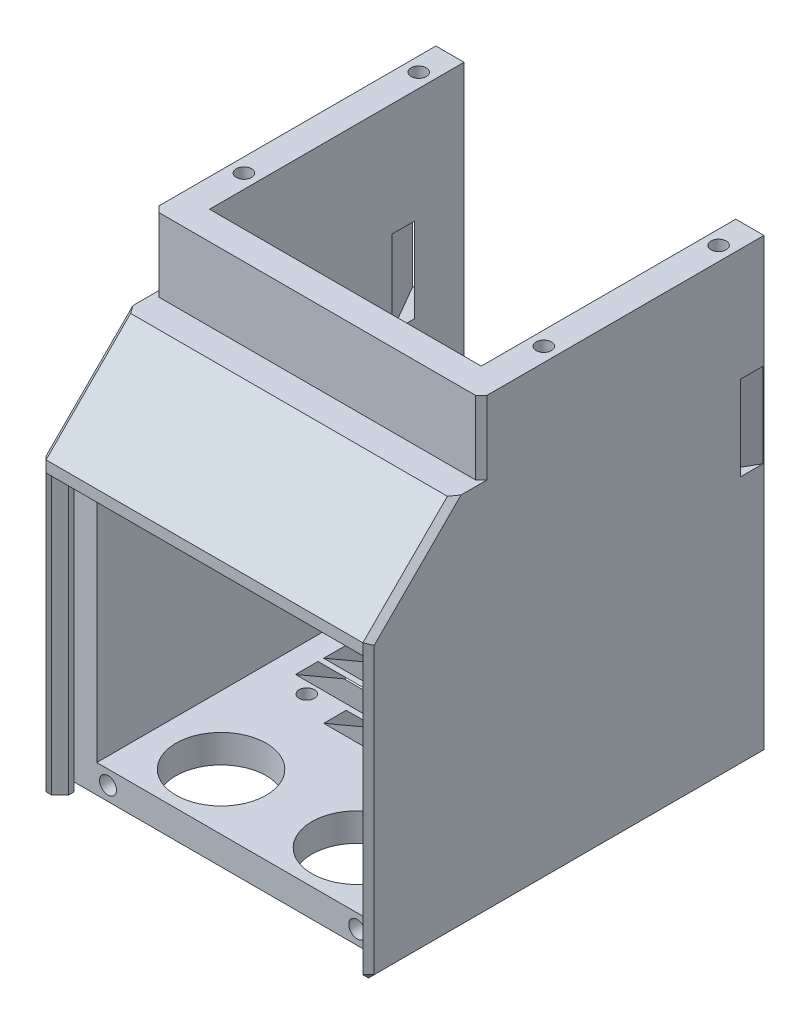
ISO-10303-21;
HEADER;
FILE_DESCRIPTION(('STEP AP214'),'2;1');
FILE_NAME('part.step','',(''),(''),'','','');
FILE_SCHEMA(('AUTOMOTIVE_DESIGN { 1 0 10303 214 1 1 1 1 }'));
ENDSEC;
DATA;
#1=APPLICATION_CONTEXT('core data for automotive mechanical design processes');
#2=APPLICATION_PROTOCOL_DEFINITION('international standard','automotive_design',2000,#1);
#3=PRODUCT_CONTEXT('',#1,'mechanical');
#4=PRODUCT('Part','Part','',(#3));
#5=PRODUCT_RELATED_PRODUCT_CATEGORY('part','',(#4));
#6=PRODUCT_DEFINITION_FORMATION('','',#4);
#7=PRODUCT_DEFINITION_CONTEXT('part definition',#1,'design');
#8=PRODUCT_DEFINITION('design','',#6,#7);
#9=PRODUCT_DEFINITION_SHAPE('','',#8);
#10=(LENGTH_UNIT() NAMED_UNIT(*) SI_UNIT(.MILLI.,.METRE.));
#11=(NAMED_UNIT(*) PLANE_ANGLE_UNIT() SI_UNIT($,.RADIAN.));
#12=(NAMED_UNIT(*) SI_UNIT($,.STERADIAN.) SOLID_ANGLE_UNIT());
#13=UNCERTAINTY_MEASURE_WITH_UNIT(LENGTH_MEASURE(1.E-05),#10,'distance_accuracy_value','');
#14=(GEOMETRIC_REPRESENTATION_CONTEXT(3) GLOBAL_UNCERTAINTY_ASSIGNED_CONTEXT((#13)) GLOBAL_UNIT_ASSIGNED_CONTEXT((#10,
#11,#12)) REPRESENTATION_CONTEXT('',''));
#15=CARTESIAN_POINT('',(0.,0.,0.));
#16=DIRECTION('',(0.,0.,1.));
#17=DIRECTION('',(1.,0.,0.));
#18=AXIS2_PLACEMENT_3D('',#15,#16,#17);
#19=CARTESIAN_POINT('',(0.,0.,1070.20000000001));
#20=DIRECTION('',(0.,0.,-1.));
#21=DIRECTION('',(-1.,0.,0.));
#22=AXIS2_PLACEMENT_3D('',#19,#20,#21);
#23=PLANE('',#22);
#24=DIRECTION('',(-1.,0.,0.));
#25=VECTOR('',#24,1.);
#26=CARTESIAN_POINT('',(-30.8042355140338,-19.8381246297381,1070.20000000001));
#27=LINE('',#26,#25);
#28=CARTESIAN_POINT('',(25.3957644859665,-19.8381246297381,1070.20000000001));
#29=VERTEX_POINT('',#28);
#30=CARTESIAN_POINT('',(-30.8042355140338,-19.8381246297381,1070.20000000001));
#31=VERTEX_POINT('',#30);
#32=EDGE_CURVE('E491',#29,#31,#27,.T.);
#33=ORIENTED_EDGE('',*,*,#32,.F.);
#34=DIRECTION('',(0.,1.,0.));
#35=VECTOR('',#34,1.);
#36=CARTESIAN_POINT('',(25.3957644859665,0.,1070.20000000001));
#37=LINE('',#36,#35);
#38=CARTESIAN_POINT('',(25.3957644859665,-17.838124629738,1070.20000000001));
#39=VERTEX_POINT('',#38);
#40=EDGE_CURVE('E1186',#29,#39,#37,.T.);
#41=ORIENTED_EDGE('',*,*,#40,.T.);
#42=DIRECTION('',(-1.,0.,0.));
#43=VECTOR('',#42,1.);
#44=CARTESIAN_POINT('',(0.,-17.838124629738,1070.20000000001));
#45=LINE('',#44,#43);
#46=CARTESIAN_POINT('',(-30.8042355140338,-17.838124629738,1070.20000000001));
#47=VERTEX_POINT('',#46);
#48=EDGE_CURVE('E1127',#39,#47,#45,.T.);
#49=ORIENTED_EDGE('',*,*,#48,.T.);
#50=DIRECTION('',(0.,-1.,0.));
#51=VECTOR('',#50,1.);
#52=CARTESIAN_POINT('',(-30.8042355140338,0.,1070.20000000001));
#53=LINE('',#52,#51);
#54=EDGE_CURVE('E1195',#47,#31,#53,.T.);
#55=ORIENTED_EDGE('',*,*,#54,.T.);
#56=EDGE_LOOP('',(#33,#41,#49,#55));
#57=FACE_BOUND('',#56,.T.);
#58=ADVANCED_FACE('F47',(#57),#23,.F.);
#59=CARTESIAN_POINT('',(0.,-69.8381246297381,0.));
#60=DIRECTION('',(0.,-1.,0.));
#61=DIRECTION('',(0.,0.,-1.));
#62=AXIS2_PLACEMENT_3D('',#59,#60,#61);
#63=PLANE('',#62);
#64=DIRECTION('',(-0.707106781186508,0.,0.707106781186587));
#65=VECTOR('',#64,1.);
#66=CARTESIAN_POINT('',(25.3957644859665,-69.8381246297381,1065.20000000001));
#67=LINE('',#66,#65);
#68=CARTESIAN_POINT('',(25.3957644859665,-69.8381246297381,1065.20000000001));
#69=VERTEX_POINT('',#68);
#70=CARTESIAN_POINT('',(23.8957644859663,-69.8381246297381,1066.70000000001));
#71=VERTEX_POINT('',#70);
#72=EDGE_CURVE('E515',#69,#71,#67,.T.);
#73=ORIENTED_EDGE('',*,*,#72,.F.);
#74=DIRECTION('',(0.,0.,1.));
#75=VECTOR('',#74,1.);
#76=CARTESIAN_POINT('',(25.3957644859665,-69.8381246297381,1070.20000000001));
#77=LINE('',#76,#75);
#78=CARTESIAN_POINT('',(25.3957644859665,-69.8381246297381,1069.20000000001));
#79=VERTEX_POINT('',#78);
#80=EDGE_CURVE('E1206',#69,#79,#77,.T.);
#81=ORIENTED_EDGE('',*,*,#80,.T.);
#82=DIRECTION('',(0.707106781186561,0.,0.707106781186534));
#83=VECTOR('',#82,1.);
#84=CARTESIAN_POINT('',(23.8957644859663,-69.8381246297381,1067.70000000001));
#85=LINE('',#84,#83);
#86=CARTESIAN_POINT('',(23.8957644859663,-69.8381246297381,1067.70000000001));
#87=VERTEX_POINT('',#86);
#88=EDGE_CURVE('E469',#87,#79,#85,.T.);
#89=ORIENTED_EDGE('',*,*,#88,.F.);
#90=DIRECTION('',(0.,0.,1.));
#91=VECTOR('',#90,1.);
#92=CARTESIAN_POINT('',(23.8957644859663,-69.8381246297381,1066.70000000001));
#93=LINE('',#92,#91);
#94=EDGE_CURVE('E517',#71,#87,#93,.T.);
#95=ORIENTED_EDGE('',*,*,#94,.F.);
#96=EDGE_LOOP('',(#73,#81,#89,#95));
#97=FACE_BOUND('',#96,.T.);
#98=ADVANCED_FACE('F1337',(#97),#63,.T.);
#99=DIRECTION('',(1.,0.,0.));
#100=VECTOR('',#99,1.);
#101=CARTESIAN_POINT('',(-30.8042355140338,-69.8381246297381,1065.20000000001));
#102=LINE('',#101,#100);
#103=CARTESIAN_POINT('',(-30.8042355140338,-69.8381246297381,1065.20000000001));
#104=VERTEX_POINT('',#103);
#105=EDGE_CURVE('E507',#104,#69,#102,.T.);
#106=ORIENTED_EDGE('',*,*,#105,.F.);
#107=DIRECTION('',(0.,0.,-1.));
#108=VECTOR('',#107,1.);
#109=CARTESIAN_POINT('',(-30.8042355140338,-69.8381246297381,1000.05000000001));
#110=LINE('',#109,#108);
#111=CARTESIAN_POINT('',(-30.8042355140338,-69.8381246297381,1000.05000000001));
#112=VERTEX_POINT('',#111);
#113=EDGE_CURVE('E1201',#104,#112,#110,.T.);
#114=ORIENTED_EDGE('',*,*,#113,.T.);
#115=DIRECTION('',(1.,0.,0.));
#116=VECTOR('',#115,1.);
#117=CARTESIAN_POINT('',(-31.8042355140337,-69.8381246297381,1000.05000000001));
#118=LINE('',#117,#116);
#119=CARTESIAN_POINT('',(25.3957644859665,-69.8381246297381,1000.05000000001));
#120=VERTEX_POINT('',#119);
#121=EDGE_CURVE('E1033',#112,#120,#118,.T.);
#122=ORIENTED_EDGE('',*,*,#121,.T.);
#123=EDGE_CURVE('E1209',#120,#69,#77,.T.);
#124=ORIENTED_EDGE('',*,*,#123,.T.);
#125=EDGE_LOOP('',(#106,#114,#122,#124));
#126=FACE_BOUND('',#125,.T.);
#127=DIRECTION('',(0.,0.,-1.));
#128=VECTOR('',#127,1.);
#129=CARTESIAN_POINT('',(7.29576448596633,-69.8381246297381,1005.38974596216));
#130=LINE('',#129,#128);
#131=CARTESIAN_POINT('',(7.29576448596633,-69.8381246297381,1005.38974596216));
#132=VERTEX_POINT('',#131);
#133=CARTESIAN_POINT('',(7.29576448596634,-69.8381246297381,1001.38974596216));
#134=VERTEX_POINT('',#133);
#135=EDGE_CURVE('E599',#132,#134,#130,.T.);
#136=ORIENTED_EDGE('',*,*,#135,.T.);
#137=DIRECTION('',(-1.,0.,0.));
#138=VECTOR('',#137,1.);
#139=CARTESIAN_POINT('',(17.2957644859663,-69.8381246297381,1001.38974596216));
#140=LINE('',#139,#138);
#141=CARTESIAN_POINT('',(-12.7042355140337,-69.8381246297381,1001.38974596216));
#142=VERTEX_POINT('',#141);
#143=EDGE_CURVE('E915',#134,#142,#140,.T.);
#144=ORIENTED_EDGE('',*,*,#143,.T.);
#145=DIRECTION('',(0.,0.,1.));
#146=VECTOR('',#145,1.);
#147=CARTESIAN_POINT('',(-12.7042355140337,-69.8381246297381,1005.38974596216));
#148=LINE('',#147,#146);
#149=CARTESIAN_POINT('',(-12.7042355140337,-69.8381246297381,1005.38974596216));
#150=VERTEX_POINT('',#149);
#151=EDGE_CURVE('E585',#142,#150,#148,.T.);
#152=ORIENTED_EDGE('',*,*,#151,.T.);
#153=DIRECTION('',(-1.,0.,0.));
#154=VECTOR('',#153,1.);
#155=CARTESIAN_POINT('',(17.2957644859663,-69.8381246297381,1005.38974596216));
#156=LINE('',#155,#154);
#157=EDGE_CURVE('E935',#132,#150,#156,.T.);
#158=ORIENTED_EDGE('',*,*,#157,.F.);
#159=EDGE_LOOP('',(#136,#144,#152,#158));
#160=FACE_BOUND('',#159,.T.);
#161=DIRECTION('',(-1.,0.,0.));
#162=VECTOR('',#161,1.);
#163=CARTESIAN_POINT('',(17.2957644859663,-69.8381246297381,1026.38974596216));
#164=LINE('',#163,#162);
#165=CARTESIAN_POINT('',(7.29576448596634,-69.8381246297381,1026.38974596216));
#166=VERTEX_POINT('',#165);
#167=CARTESIAN_POINT('',(-12.7042355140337,-69.8381246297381,1026.38974596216));
#168=VERTEX_POINT('',#167);
#169=EDGE_CURVE('E725',#166,#168,#164,.T.);
#170=ORIENTED_EDGE('',*,*,#169,.T.);
#171=DIRECTION('',(0.,0.,1.));
#172=VECTOR('',#171,1.);
#173=CARTESIAN_POINT('',(-12.7042355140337,-69.8381246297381,1026.38974596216));
#174=LINE('',#173,#172);
#175=CARTESIAN_POINT('',(-12.7042355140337,-69.8381246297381,1030.38974596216));
#176=VERTEX_POINT('',#175);
#177=EDGE_CURVE('E606',#168,#176,#174,.T.);
#178=ORIENTED_EDGE('',*,*,#177,.T.);
#179=DIRECTION('',(-1.,0.,0.));
#180=VECTOR('',#179,1.);
#181=CARTESIAN_POINT('',(17.2957644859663,-69.8381246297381,1030.38974596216));
#182=LINE('',#181,#180);
#183=CARTESIAN_POINT('',(7.29576448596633,-69.8381246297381,1030.38974596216));
#184=VERTEX_POINT('',#183);
#185=EDGE_CURVE('E734',#184,#176,#182,.T.);
#186=ORIENTED_EDGE('',*,*,#185,.F.);
#187=DIRECTION('',(0.,0.,-1.));
#188=VECTOR('',#187,1.);
#189=CARTESIAN_POINT('',(7.29576448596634,-69.8381246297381,1026.38974596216));
#190=LINE('',#189,#188);
#191=EDGE_CURVE('E70',#184,#166,#190,.T.);
#192=ORIENTED_EDGE('',*,*,#191,.T.);
#193=EDGE_LOOP('',(#170,#178,#186,#192));
#194=FACE_BOUND('',#193,.T.);
#195=CARTESIAN_POINT('',(-14.7542355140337,-69.8381246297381,1055.20000000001));
#196=DIRECTION('',(0.,-1.,0.));
#197=DIRECTION('',(0.,0.,-1.));
#198=AXIS2_PLACEMENT_3D('',#195,#196,#197);
#199=CIRCLE('',#198,8.00000000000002);
#200=CARTESIAN_POINT('',(-14.7542355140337,-69.8381246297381,1047.20000000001));
#201=VERTEX_POINT('',#200);
#202=EDGE_CURVE('E945',#201,#201,#199,.T.);
#203=ORIENTED_EDGE('',*,*,#202,.F.);
#204=EDGE_LOOP('',(#203));
#205=FACE_BOUND('',#204,.T.);
#206=CARTESIAN_POINT('',(9.34576448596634,-69.8381246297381,1055.20000000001));
#207=DIRECTION('',(0.,-1.,0.));
#208=DIRECTION('',(0.,0.,1.));
#209=AXIS2_PLACEMENT_3D('',#206,#207,#208);
#210=CIRCLE('',#209,8.00000000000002);
#211=CARTESIAN_POINT('',(9.34576448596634,-69.8381246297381,1063.20000000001));
#212=VERTEX_POINT('',#211);
#213=EDGE_CURVE('E946',#212,#212,#210,.T.);
#214=ORIENTED_EDGE('',*,*,#213,.F.);
#215=EDGE_LOOP('',(#214));
#216=FACE_BOUND('',#215,.T.);
#217=DIRECTION('',(0.,0.,1.));
#218=VECTOR('',#217,1.);
#219=CARTESIAN_POINT('',(17.2957644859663,-69.8381246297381,1010.38974596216));
#220=LINE('',#219,#218);
#221=CARTESIAN_POINT('',(17.2957644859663,-69.8381246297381,1006.38974596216));
#222=VERTEX_POINT('',#221);
#223=CARTESIAN_POINT('',(17.2957644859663,-69.8381246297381,1010.38974596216));
#224=VERTEX_POINT('',#223);
#225=EDGE_CURVE('E885',#222,#224,#220,.T.);
#226=ORIENTED_EDGE('',*,*,#225,.F.);
#227=DIRECTION('',(-1.,0.,0.));
#228=VECTOR('',#227,1.);
#229=CARTESIAN_POINT('',(17.2957644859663,-69.8381246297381,1006.38974596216));
#230=LINE('',#229,#228);
#231=CARTESIAN_POINT('',(-22.7042355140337,-69.8381246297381,1006.38974596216));
#232=VERTEX_POINT('',#231);
#233=EDGE_CURVE('E894',#222,#232,#230,.T.);
#234=ORIENTED_EDGE('',*,*,#233,.T.);
#235=DIRECTION('',(0.,0.,1.));
#236=VECTOR('',#235,1.);
#237=CARTESIAN_POINT('',(-22.7042355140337,-69.8381246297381,1010.38974596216));
#238=LINE('',#237,#236);
#239=CARTESIAN_POINT('',(-22.7042355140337,-69.8381246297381,1010.38974596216));
#240=VERTEX_POINT('',#239);
#241=EDGE_CURVE('E898',#232,#240,#238,.T.);
#242=ORIENTED_EDGE('',*,*,#241,.T.);
#243=DIRECTION('',(-1.,0.,0.));
#244=VECTOR('',#243,1.);
#245=CARTESIAN_POINT('',(17.2957644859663,-69.8381246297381,1010.38974596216));
#246=LINE('',#245,#244);
#247=EDGE_CURVE('E920',#224,#240,#246,.T.);
#248=ORIENTED_EDGE('',*,*,#247,.F.);
#249=EDGE_LOOP('',(#226,#234,#242,#248));
#250=FACE_BOUND('',#249,.T.);
#251=DIRECTION('',(0.,0.,1.));
#252=VECTOR('',#251,1.);
#253=CARTESIAN_POINT('',(17.2957644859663,-69.8381246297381,1025.38974596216));
#254=LINE('',#253,#252);
#255=CARTESIAN_POINT('',(17.2957644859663,-69.8381246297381,1021.38974596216));
#256=VERTEX_POINT('',#255);
#257=CARTESIAN_POINT('',(17.2957644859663,-69.8381246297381,1025.38974596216));
#258=VERTEX_POINT('',#257);
#259=EDGE_CURVE('E742',#256,#258,#254,.T.);
#260=ORIENTED_EDGE('',*,*,#259,.F.);
#261=DIRECTION('',(-1.,0.,0.));
#262=VECTOR('',#261,1.);
#263=CARTESIAN_POINT('',(17.2957644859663,-69.8381246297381,1021.38974596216));
#264=LINE('',#263,#262);
#265=CARTESIAN_POINT('',(-22.7042355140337,-69.8381246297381,1021.38974596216));
#266=VERTEX_POINT('',#265);
#267=EDGE_CURVE('E754',#256,#266,#264,.T.);
#268=ORIENTED_EDGE('',*,*,#267,.T.);
#269=DIRECTION('',(0.,0.,1.));
#270=VECTOR('',#269,1.);
#271=CARTESIAN_POINT('',(-22.7042355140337,-69.8381246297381,1025.38974596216));
#272=LINE('',#271,#270);
#273=CARTESIAN_POINT('',(-22.7042355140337,-69.8381246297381,1025.38974596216));
#274=VERTEX_POINT('',#273);
#275=EDGE_CURVE('E758',#266,#274,#272,.T.);
#276=ORIENTED_EDGE('',*,*,#275,.T.);
#277=DIRECTION('',(-1.,0.,0.));
#278=VECTOR('',#277,1.);
#279=CARTESIAN_POINT('',(17.2957644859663,-69.8381246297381,1025.38974596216));
#280=LINE('',#279,#278);
#281=EDGE_CURVE('E779',#258,#274,#280,.T.);
#282=ORIENTED_EDGE('',*,*,#281,.F.);
#283=EDGE_LOOP('',(#260,#268,#276,#282));
#284=FACE_BOUND('',#283,.T.);
#285=DIRECTION('',(0.,0.,1.));
#286=VECTOR('',#285,1.);
#287=CARTESIAN_POINT('',(17.2957644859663,-69.8381246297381,1015.38974596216));
#288=LINE('',#287,#286);
#289=CARTESIAN_POINT('',(17.2957644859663,-69.8381246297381,1011.38974596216));
#290=VERTEX_POINT('',#289);
#291=CARTESIAN_POINT('',(17.2957644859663,-69.8381246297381,1015.38974596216));
#292=VERTEX_POINT('',#291);
#293=EDGE_CURVE('E834',#290,#292,#288,.T.);
#294=ORIENTED_EDGE('',*,*,#293,.F.);
#295=DIRECTION('',(-1.,0.,0.));
#296=VECTOR('',#295,1.);
#297=CARTESIAN_POINT('',(17.2957644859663,-69.8381246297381,1011.38974596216));
#298=LINE('',#297,#296);
#299=CARTESIAN_POINT('',(-22.7042355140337,-69.8381246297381,1011.38974596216));
#300=VERTEX_POINT('',#299);
#301=EDGE_CURVE('E850',#290,#300,#298,.T.);
#302=ORIENTED_EDGE('',*,*,#301,.T.);
#303=DIRECTION('',(0.,0.,1.));
#304=VECTOR('',#303,1.);
#305=CARTESIAN_POINT('',(-22.7042355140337,-69.8381246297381,1015.38974596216));
#306=LINE('',#305,#304);
#307=CARTESIAN_POINT('',(-22.7042355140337,-69.8381246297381,1015.38974596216));
#308=VERTEX_POINT('',#307);
#309=EDGE_CURVE('E854',#300,#308,#306,.T.);
#310=ORIENTED_EDGE('',*,*,#309,.T.);
#311=DIRECTION('',(-1.,0.,0.));
#312=VECTOR('',#311,1.);
#313=CARTESIAN_POINT('',(17.2957644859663,-69.8381246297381,1015.38974596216));
#314=LINE('',#313,#312);
#315=EDGE_CURVE('E872',#292,#308,#314,.T.);
#316=ORIENTED_EDGE('',*,*,#315,.F.);
#317=EDGE_LOOP('',(#294,#302,#310,#316));
#318=FACE_BOUND('',#317,.T.);
#319=DIRECTION('',(0.,0.,1.));
#320=VECTOR('',#319,1.);
#321=CARTESIAN_POINT('',(17.2957644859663,-69.8381246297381,1020.38974596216));
#322=LINE('',#321,#320);
#323=CARTESIAN_POINT('',(17.2957644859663,-69.8381246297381,1016.38974596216));
#324=VERTEX_POINT('',#323);
#325=CARTESIAN_POINT('',(17.2957644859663,-69.8381246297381,1020.38974596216));
#326=VERTEX_POINT('',#325);
#327=EDGE_CURVE('E790',#324,#326,#322,.T.);
#328=ORIENTED_EDGE('',*,*,#327,.F.);
#329=DIRECTION('',(-1.,0.,0.));
#330=VECTOR('',#329,1.);
#331=CARTESIAN_POINT('',(17.2957644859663,-69.8381246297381,1016.38974596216));
#332=LINE('',#331,#330);
#333=CARTESIAN_POINT('',(-22.7042355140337,-69.8381246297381,1016.38974596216));
#334=VERTEX_POINT('',#333);
#335=EDGE_CURVE('E802',#324,#334,#332,.T.);
#336=ORIENTED_EDGE('',*,*,#335,.T.);
#337=DIRECTION('',(0.,0.,1.));
#338=VECTOR('',#337,1.);
#339=CARTESIAN_POINT('',(-22.7042355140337,-69.8381246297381,1020.38974596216));
#340=LINE('',#339,#338);
#341=CARTESIAN_POINT('',(-22.7042355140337,-69.8381246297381,1020.38974596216));
#342=VERTEX_POINT('',#341);
#343=EDGE_CURVE('E803',#334,#342,#340,.T.);
#344=ORIENTED_EDGE('',*,*,#343,.T.);
#345=DIRECTION('',(-1.,0.,0.));
#346=VECTOR('',#345,1.);
#347=CARTESIAN_POINT('',(17.2957644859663,-69.8381246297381,1020.38974596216));
#348=LINE('',#347,#346);
#349=EDGE_CURVE('E822',#326,#342,#348,.T.);
#350=ORIENTED_EDGE('',*,*,#349,.F.);
#351=EDGE_LOOP('',(#328,#336,#344,#350));
#352=FACE_BOUND('',#351,.T.);
#353=ADVANCED_FACE('F1344',(#126,#160,#194,#205,#216,#250,#284,#318,#352),#63,.T.);
#354=CARTESIAN_POINT('',(17.2957644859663,-69.8381246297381,1001.38974596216));
#355=DIRECTION('',(0.,0.866025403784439,-0.499999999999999));
#356=DIRECTION('',(0.,0.499999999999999,0.866025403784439));
#357=AXIS2_PLACEMENT_3D('',#354,#355,#356);
#358=PLANE('',#357);
#359=DIRECTION('',(0.,-0.499999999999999,-0.866025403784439));
#360=VECTOR('',#359,1.);
#361=CARTESIAN_POINT('',(7.29576448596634,-56.7603774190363,1024.04106857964));
#362=LINE('',#361,#360);
#363=CARTESIAN_POINT('',(7.29576448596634,-64.8381246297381,1010.05000000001));
#364=VERTEX_POINT('',#363);
#365=EDGE_CURVE('E598',#364,#134,#362,.T.);
#366=ORIENTED_EDGE('',*,*,#365,.F.);
#367=DIRECTION('',(-1.,0.,0.));
#368=VECTOR('',#367,1.);
#369=CARTESIAN_POINT('',(17.2957644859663,-64.8381246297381,1010.05000000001));
#370=LINE('',#369,#368);
#371=CARTESIAN_POINT('',(-12.7042355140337,-64.8381246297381,1010.05000000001));
#372=VERTEX_POINT('',#371);
#373=EDGE_CURVE('E923',#364,#372,#370,.T.);
#374=ORIENTED_EDGE('',*,*,#373,.T.);
#375=DIRECTION('',(0.,-0.499999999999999,-0.866025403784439));
#376=VECTOR('',#375,1.);
#377=CARTESIAN_POINT('',(-12.7042355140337,-56.7603774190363,1024.04106857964));
#378=LINE('',#377,#376);
#379=EDGE_CURVE('E578',#372,#142,#378,.T.);
#380=ORIENTED_EDGE('',*,*,#379,.T.);
#381=ORIENTED_EDGE('',*,*,#143,.F.);
#382=EDGE_LOOP('',(#366,#374,#380,#381));
#383=FACE_BOUND('',#382,.T.);
#384=ADVANCED_FACE('F1678',(#383),#358,.F.);
#385=CARTESIAN_POINT('',(17.2957644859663,-64.8381246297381,1014.05000000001));
#386=DIRECTION('',(0.,-0.866025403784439,0.499999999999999));
#387=DIRECTION('',(0.,-0.499999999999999,-0.866025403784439));
#388=AXIS2_PLACEMENT_3D('',#385,#386,#387);
#389=PLANE('',#388);
#390=DIRECTION('',(-1.,0.,0.));
#391=VECTOR('',#390,1.);
#392=CARTESIAN_POINT('',(17.2957644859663,-64.8381246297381,1014.05000000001));
#393=LINE('',#392,#391);
#394=CARTESIAN_POINT('',(7.29576448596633,-64.838124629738,1014.05000000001));
#395=VERTEX_POINT('',#394);
#396=CARTESIAN_POINT('',(-12.7042355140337,-64.8381246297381,1014.05000000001));
#397=VERTEX_POINT('',#396);
#398=EDGE_CURVE('E926',#395,#397,#393,.T.);
#399=ORIENTED_EDGE('',*,*,#398,.F.);
#400=DIRECTION('',(0.,-0.499999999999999,-0.866025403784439));
#401=VECTOR('',#400,1.);
#402=CARTESIAN_POINT('',(7.29576448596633,-56.7603774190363,1028.04106857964));
#403=LINE('',#402,#401);
#404=EDGE_CURVE('E593',#395,#132,#403,.T.);
#405=ORIENTED_EDGE('',*,*,#404,.T.);
#406=ORIENTED_EDGE('',*,*,#157,.T.);
#407=DIRECTION('',(0.,-0.499999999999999,-0.866025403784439));
#408=VECTOR('',#407,1.);
#409=CARTESIAN_POINT('',(-12.7042355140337,-56.7603774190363,1028.04106857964));
#410=LINE('',#409,#408);
#411=EDGE_CURVE('E581',#397,#150,#410,.T.);
#412=ORIENTED_EDGE('',*,*,#411,.F.);
#413=EDGE_LOOP('',(#399,#405,#406,#412));
#414=FACE_BOUND('',#413,.T.);
#415=ADVANCED_FACE('F1684',(#414),#389,.F.);
#416=CARTESIAN_POINT('',(17.2957644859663,-69.8381246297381,1026.38974596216));
#417=DIRECTION('',(0.,0.866025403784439,-0.499999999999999));
#418=DIRECTION('',(0.,0.499999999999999,0.866025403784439));
#419=AXIS2_PLACEMENT_3D('',#416,#417,#418);
#420=PLANE('',#419);
#421=DIRECTION('',(-1.,0.,0.));
#422=VECTOR('',#421,1.);
#423=CARTESIAN_POINT('',(17.2957644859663,-64.8381246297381,1035.05000000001));
#424=LINE('',#423,#422);
#425=CARTESIAN_POINT('',(7.29576448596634,-64.8381246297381,1035.05000000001));
#426=VERTEX_POINT('',#425);
#427=CARTESIAN_POINT('',(-12.7042355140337,-64.8381246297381,1035.05000000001));
#428=VERTEX_POINT('',#427);
#429=EDGE_CURVE('E721',#426,#428,#424,.T.);
#430=ORIENTED_EDGE('',*,*,#429,.T.);
#431=DIRECTION('',(0.,-0.499999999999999,-0.866025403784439));
#432=VECTOR('',#431,1.);
#433=CARTESIAN_POINT('',(-12.7042355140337,-56.7603774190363,1049.04106857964));
#434=LINE('',#433,#432);
#435=EDGE_CURVE('E77',#428,#168,#434,.T.);
#436=ORIENTED_EDGE('',*,*,#435,.T.);
#437=ORIENTED_EDGE('',*,*,#169,.F.);
#438=DIRECTION('',(0.,-0.499999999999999,-0.866025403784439));
#439=VECTOR('',#438,1.);
#440=CARTESIAN_POINT('',(7.29576448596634,-56.7603774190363,1049.04106857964));
#441=LINE('',#440,#439);
#442=EDGE_CURVE('E626',#426,#166,#441,.T.);
#443=ORIENTED_EDGE('',*,*,#442,.F.);
#444=EDGE_LOOP('',(#430,#436,#437,#443));
#445=FACE_BOUND('',#444,.T.);
#446=ADVANCED_FACE('F1694',(#445),#420,.F.);
#447=CARTESIAN_POINT('',(17.2957644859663,-64.8381246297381,1039.05000000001));
#448=DIRECTION('',(0.,-0.866025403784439,0.499999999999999));
#449=DIRECTION('',(0.,-0.499999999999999,-0.866025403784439));
#450=AXIS2_PLACEMENT_3D('',#447,#448,#449);
#451=PLANE('',#450);
#452=DIRECTION('',(0.,-0.499999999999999,-0.866025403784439));
#453=VECTOR('',#452,1.);
#454=CARTESIAN_POINT('',(-12.7042355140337,-56.7603774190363,1053.04106857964));
#455=LINE('',#454,#453);
#456=CARTESIAN_POINT('',(-12.7042355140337,-64.8381246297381,1039.05000000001));
#457=VERTEX_POINT('',#456);
#458=EDGE_CURVE('E614',#457,#176,#455,.T.);
#459=ORIENTED_EDGE('',*,*,#458,.F.);
#460=DIRECTION('',(-1.,0.,0.));
#461=VECTOR('',#460,1.);
#462=CARTESIAN_POINT('',(17.2957644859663,-64.8381246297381,1039.05000000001));
#463=LINE('',#462,#461);
#464=CARTESIAN_POINT('',(7.29576448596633,-64.838124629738,1039.05000000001));
#465=VERTEX_POINT('',#464);
#466=EDGE_CURVE('E726',#465,#457,#463,.T.);
#467=ORIENTED_EDGE('',*,*,#466,.F.);
#468=DIRECTION('',(0.,-0.499999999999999,-0.866025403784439));
#469=VECTOR('',#468,1.);
#470=CARTESIAN_POINT('',(7.29576448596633,-56.7603774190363,1053.04106857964));
#471=LINE('',#470,#469);
#472=EDGE_CURVE('E627',#465,#184,#471,.T.);
#473=ORIENTED_EDGE('',*,*,#472,.T.);
#474=ORIENTED_EDGE('',*,*,#185,.T.);
#475=EDGE_LOOP('',(#459,#467,#473,#474));
#476=FACE_BOUND('',#475,.T.);
#477=ADVANCED_FACE('F1698',(#476),#451,.F.);
#478=CARTESIAN_POINT('',(-26.8042355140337,15.1618753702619,1050.20000000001));
#479=DIRECTION('',(1.,0.,0.));
#480=DIRECTION('',(0.,0.,-1.));
#481=AXIS2_PLACEMENT_3D('',#478,#479,#480);
#482=PLANE('',#481);
#483=DIRECTION('',(0.,-1.,0.));
#484=VECTOR('',#483,1.);
#485=CARTESIAN_POINT('',(-26.8042355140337,15.1618753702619,1000.05000000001));
#486=LINE('',#485,#484);
#487=CARTESIAN_POINT('',(-26.8042355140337,10.1618753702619,1000.05000000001));
#488=VERTEX_POINT('',#487);
#489=CARTESIAN_POINT('',(-26.8042355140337,-64.8381246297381,1000.05000000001));
#490=VERTEX_POINT('',#489);
#491=EDGE_CURVE('E1045',#488,#490,#486,.T.);
#492=ORIENTED_EDGE('',*,*,#491,.F.);
#493=DIRECTION('',(0.,0.,1.));
#494=VECTOR('',#493,1.);
#495=CARTESIAN_POINT('',(-26.8042355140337,10.1618753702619,0.));
#496=LINE('',#495,#494);
#497=CARTESIAN_POINT('',(-26.8042355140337,10.1618753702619,1045.20000000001));
#498=VERTEX_POINT('',#497);
#499=EDGE_CURVE('E1067',#488,#498,#496,.T.);
#500=ORIENTED_EDGE('',*,*,#499,.T.);
#501=DIRECTION('',(0.,-1.,0.));
#502=VECTOR('',#501,1.);
#503=CARTESIAN_POINT('',(-26.8042355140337,15.1618753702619,1045.20000000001));
#504=LINE('',#503,#502);
#505=CARTESIAN_POINT('',(-26.8042355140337,-7.83812462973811,1045.20000000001));
#506=VERTEX_POINT('',#505);
#507=EDGE_CURVE('E1062',#498,#506,#504,.T.);
#508=ORIENTED_EDGE('',*,*,#507,.T.);
#509=DIRECTION('',(0.,0.,-1.));
#510=VECTOR('',#509,1.);
#511=CARTESIAN_POINT('',(-26.8042355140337,-7.83812462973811,1050.20000000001));
#512=LINE('',#511,#510);
#513=CARTESIAN_POINT('',(-26.8042355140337,-7.83812462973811,1053.12893218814));
#514=VERTEX_POINT('',#513);
#515=EDGE_CURVE('E1074',#514,#506,#512,.T.);
#516=ORIENTED_EDGE('',*,*,#515,.F.);
#517=DIRECTION('',(0.,-0.707106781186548,0.707106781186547));
#518=VECTOR('',#517,1.);
#519=CARTESIAN_POINT('',(-26.8042355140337,-21.3736585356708,1066.66446609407));
#520=LINE('',#519,#518);
#521=CARTESIAN_POINT('',(-26.8042355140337,-19.9091924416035,1065.20000000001));
#522=VERTEX_POINT('',#521);
#523=EDGE_CURVE('E1102',#522,#514,#520,.F.);
#524=ORIENTED_EDGE('',*,*,#523,.F.);
#525=DIRECTION('',(0.,-1.,0.));
#526=VECTOR('',#525,1.);
#527=CARTESIAN_POINT('',(-26.8042355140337,0.,1065.20000000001));
#528=LINE('',#527,#526);
#529=CARTESIAN_POINT('',(-26.8042355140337,-64.8381246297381,1065.20000000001));
#530=VERTEX_POINT('',#529);
#531=EDGE_CURVE('E1084',#522,#530,#528,.T.);
#532=ORIENTED_EDGE('',*,*,#531,.T.);
#533=DIRECTION('',(0.,0.,1.));
#534=VECTOR('',#533,1.);
#535=CARTESIAN_POINT('',(-26.8042355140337,-64.8381246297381,0.));
#536=LINE('',#535,#534);
#537=EDGE_CURVE('E1087',#490,#530,#536,.T.);
#538=ORIENTED_EDGE('',*,*,#537,.F.);
#539=EDGE_LOOP('',(#492,#500,#508,#516,#524,#532,#538));
#540=FACE_BOUND('',#539,.T.);
#541=DIRECTION('',(0.,0.,1.));
#542=VECTOR('',#541,1.);
#543=CARTESIAN_POINT('',(-26.8042355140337,-9.83812462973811,1012.86025403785));
#544=LINE('',#543,#542);
#545=CARTESIAN_POINT('',(-26.8042355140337,-9.83812462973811,1008.86025403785));
#546=VERTEX_POINT('',#545);
#547=CARTESIAN_POINT('',(-26.8042355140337,-9.83812462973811,1012.86025403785));
#548=VERTEX_POINT('',#547);
#549=EDGE_CURVE('E649',#546,#548,#544,.T.);
#550=ORIENTED_EDGE('',*,*,#549,.F.);
#551=DIRECTION('',(0.,-1.,0.));
#552=VECTOR('',#551,1.);
#553=CARTESIAN_POINT('',(-26.8042355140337,-9.83812462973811,1008.86025403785));
#554=LINE('',#553,#552);
#555=CARTESIAN_POINT('',(-26.8042355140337,-24.8381246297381,1008.86025403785));
#556=VERTEX_POINT('',#555);
#557=EDGE_CURVE('E652',#546,#556,#554,.T.);
#558=ORIENTED_EDGE('',*,*,#557,.T.);
#559=DIRECTION('',(0.,0.,1.));
#560=VECTOR('',#559,1.);
#561=CARTESIAN_POINT('',(-26.8042355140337,-24.8381246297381,1012.86025403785));
#562=LINE('',#561,#560);
#563=CARTESIAN_POINT('',(-26.8042355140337,-24.8381246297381,1012.86025403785));
#564=VERTEX_POINT('',#563);
#565=EDGE_CURVE('E638',#556,#564,#562,.T.);
#566=ORIENTED_EDGE('',*,*,#565,.T.);
#567=DIRECTION('',(0.,-1.,0.));
#568=VECTOR('',#567,1.);
#569=CARTESIAN_POINT('',(-26.8042355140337,-9.83812462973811,1012.86025403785));
#570=LINE('',#569,#568);
#571=EDGE_CURVE('E670',#548,#564,#570,.T.);
#572=ORIENTED_EDGE('',*,*,#571,.F.);
#573=EDGE_LOOP('',(#550,#558,#566,#572));
#574=FACE_BOUND('',#573,.T.);
#575=ADVANCED_FACE('F1291',(#540,#574),#482,.T.);
#576=CARTESIAN_POINT('',(21.3957644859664,15.1618753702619,1050.20000000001));
#577=DIRECTION('',(-1.,0.,0.));
#578=DIRECTION('',(0.,0.,1.));
#579=AXIS2_PLACEMENT_3D('',#576,#577,#578);
#580=PLANE('',#579);
#581=DIRECTION('',(0.,1.,0.));
#582=VECTOR('',#581,1.);
#583=CARTESIAN_POINT('',(21.3957644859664,15.1618753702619,1000.05000000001));
#584=LINE('',#583,#582);
#585=CARTESIAN_POINT('',(21.3957644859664,-64.8381246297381,1000.05000000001));
#586=VERTEX_POINT('',#585);
#587=CARTESIAN_POINT('',(21.3957644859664,10.1618753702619,1000.05000000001));
#588=VERTEX_POINT('',#587);
#589=EDGE_CURVE('E1050',#586,#588,#584,.T.);
#590=ORIENTED_EDGE('',*,*,#589,.F.);
#591=DIRECTION('',(0.,0.,-1.));
#592=VECTOR('',#591,1.);
#593=CARTESIAN_POINT('',(21.3957644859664,-64.8381246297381,0.));
#594=LINE('',#593,#592);
#595=CARTESIAN_POINT('',(21.3957644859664,-64.8381246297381,1065.20000000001));
#596=VERTEX_POINT('',#595);
#597=EDGE_CURVE('E1075',#596,#586,#594,.T.);
#598=ORIENTED_EDGE('',*,*,#597,.F.);
#599=DIRECTION('',(0.,1.,0.));
#600=VECTOR('',#599,1.);
#601=CARTESIAN_POINT('',(21.3957644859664,0.,1065.20000000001));
#602=LINE('',#601,#600);
#603=CARTESIAN_POINT('',(21.3957644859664,-19.9091924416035,1065.20000000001));
#604=VERTEX_POINT('',#603);
#605=EDGE_CURVE('E1057',#596,#604,#602,.T.);
#606=ORIENTED_EDGE('',*,*,#605,.T.);
#607=DIRECTION('',(0.,0.707106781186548,-0.707106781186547));
#608=VECTOR('',#607,1.);
#609=CARTESIAN_POINT('',(21.3957644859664,-21.3736585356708,1066.66446609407));
#610=LINE('',#609,#608);
#611=CARTESIAN_POINT('',(21.3957644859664,-7.83812462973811,1053.12893218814));
#612=VERTEX_POINT('',#611);
#613=EDGE_CURVE('E1078',#612,#604,#610,.F.);
#614=ORIENTED_EDGE('',*,*,#613,.F.);
#615=DIRECTION('',(0.,0.,-1.));
#616=VECTOR('',#615,1.);
#617=CARTESIAN_POINT('',(21.3957644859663,-7.83812462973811,1070.20000000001));
#618=LINE('',#617,#616);
#619=CARTESIAN_POINT('',(21.3957644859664,-7.83812462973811,1045.20000000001));
#620=VERTEX_POINT('',#619);
#621=EDGE_CURVE('E1073',#612,#620,#618,.T.);
#622=ORIENTED_EDGE('',*,*,#621,.T.);
#623=DIRECTION('',(0.,-1.,0.));
#624=VECTOR('',#623,1.);
#625=CARTESIAN_POINT('',(21.3957644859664,15.1618753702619,1045.20000000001));
#626=LINE('',#625,#624);
#627=CARTESIAN_POINT('',(21.3957644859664,10.1618753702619,1045.20000000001));
#628=VERTEX_POINT('',#627);
#629=EDGE_CURVE('E1059',#628,#620,#626,.T.);
#630=ORIENTED_EDGE('',*,*,#629,.F.);
#631=DIRECTION('',(0.,0.,-1.));
#632=VECTOR('',#631,1.);
#633=CARTESIAN_POINT('',(21.3957644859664,10.1618753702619,0.));
#634=LINE('',#633,#632);
#635=EDGE_CURVE('E1089',#628,#588,#634,.T.);
#636=ORIENTED_EDGE('',*,*,#635,.T.);
#637=EDGE_LOOP('',(#590,#598,#606,#614,#622,#630,#636));
#638=FACE_BOUND('',#637,.T.);
#639=DIRECTION('',(0.,0.,1.));
#640=VECTOR('',#639,1.);
#641=CARTESIAN_POINT('',(21.3957644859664,-9.83812462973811,1012.86025403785));
#642=LINE('',#641,#640);
#643=CARTESIAN_POINT('',(21.3957644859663,-9.83812462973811,1008.86025403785));
#644=VERTEX_POINT('',#643);
#645=CARTESIAN_POINT('',(21.3957644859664,-9.83812462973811,1012.86025403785));
#646=VERTEX_POINT('',#645);
#647=EDGE_CURVE('E684',#644,#646,#642,.T.);
#648=ORIENTED_EDGE('',*,*,#647,.T.);
#649=DIRECTION('',(0.,-1.,0.));
#650=VECTOR('',#649,1.);
#651=CARTESIAN_POINT('',(21.3957644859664,-9.83812462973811,1012.86025403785));
#652=LINE('',#651,#650);
#653=CARTESIAN_POINT('',(21.3957644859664,-24.8381246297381,1012.86025403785));
#654=VERTEX_POINT('',#653);
#655=EDGE_CURVE('E713',#646,#654,#652,.T.);
#656=ORIENTED_EDGE('',*,*,#655,.T.);
#657=DIRECTION('',(0.,0.,1.));
#658=VECTOR('',#657,1.);
#659=CARTESIAN_POINT('',(21.3957644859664,-24.8381246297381,1012.86025403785));
#660=LINE('',#659,#658);
#661=CARTESIAN_POINT('',(21.3957644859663,-24.8381246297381,1008.86025403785));
#662=VERTEX_POINT('',#661);
#663=EDGE_CURVE('E699',#662,#654,#660,.T.);
#664=ORIENTED_EDGE('',*,*,#663,.F.);
#665=DIRECTION('',(0.,-1.,0.));
#666=VECTOR('',#665,1.);
#667=CARTESIAN_POINT('',(21.3957644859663,-9.83812462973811,1008.86025403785));
#668=LINE('',#667,#666);
#669=EDGE_CURVE('E716',#644,#662,#668,.T.);
#670=ORIENTED_EDGE('',*,*,#669,.F.);
#671=EDGE_LOOP('',(#648,#656,#664,#670));
#672=FACE_BOUND('',#671,.T.);
#673=ADVANCED_FACE('F1301',(#638,#672),#580,.T.);
#674=DIRECTION('',(-0.707106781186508,0.,-0.707106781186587));
#675=VECTOR('',#674,1.);
#676=CARTESIAN_POINT('',(-30.8042355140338,-69.8381246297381,1065.20000000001));
#677=LINE('',#676,#675);
#678=CARTESIAN_POINT('',(-29.3042355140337,-69.8381246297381,1066.70000000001));
#679=VERTEX_POINT('',#678);
#680=EDGE_CURVE('E502',#679,#104,#677,.T.);
#681=ORIENTED_EDGE('',*,*,#680,.F.);
#682=DIRECTION('',(0.,0.,-1.));
#683=VECTOR('',#682,1.);
#684=CARTESIAN_POINT('',(-29.3042355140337,-69.8381246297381,1066.70000000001));
#685=LINE('',#684,#683);
#686=CARTESIAN_POINT('',(-29.3042355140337,-69.8381246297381,1067.70000000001));
#687=VERTEX_POINT('',#686);
#688=EDGE_CURVE('E443',#687,#679,#685,.T.);
#689=ORIENTED_EDGE('',*,*,#688,.F.);
#690=DIRECTION('',(0.707106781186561,0.,-0.707106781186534));
#691=VECTOR('',#690,1.);
#692=CARTESIAN_POINT('',(-29.3042355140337,-69.8381246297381,1067.70000000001));
#693=LINE('',#692,#691);
#694=CARTESIAN_POINT('',(-30.8042355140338,-69.8381246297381,1069.20000000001));
#695=VERTEX_POINT('',#694);
#696=EDGE_CURVE('E463',#695,#687,#693,.T.);
#697=ORIENTED_EDGE('',*,*,#696,.F.);
#698=EDGE_CURVE('E1205',#695,#104,#110,.T.);
#699=ORIENTED_EDGE('',*,*,#698,.T.);
#700=EDGE_LOOP('',(#681,#689,#697,#699));
#701=FACE_BOUND('',#700,.T.);
#702=ADVANCED_FACE('F1348',(#701),#63,.T.);
#703=CARTESIAN_POINT('',(-31.8042355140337,-69.8381246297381,1000.05000000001));
#704=DIRECTION('',(0.,0.,1.));
#705=DIRECTION('',(1.,0.,0.));
#706=AXIS2_PLACEMENT_3D('',#703,#704,#705);
#707=PLANE('',#706);
#708=CARTESIAN_POINT('',(-29.3042355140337,-67.3381246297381,1000.05000000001));
#709=DIRECTION('',(0.,0.,-1.));
#710=DIRECTION('',(-1.,0.,0.));
#711=AXIS2_PLACEMENT_3D('',#708,#709,#710);
#712=CIRCLE('',#711,1.35);
#713=CARTESIAN_POINT('',(-30.6542355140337,-67.3381246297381,1000.05000000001));
#714=VERTEX_POINT('',#713);
#715=EDGE_CURVE('E963',#714,#714,#712,.T.);
#716=ORIENTED_EDGE('',*,*,#715,.F.);
#717=EDGE_LOOP('',(#716));
#718=FACE_BOUND('',#717,.T.);
#719=CARTESIAN_POINT('',(23.8957644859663,-6.83812462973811,1000.05000000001));
#720=DIRECTION('',(0.,0.,-1.));
#721=DIRECTION('',(1.,0.,0.));
#722=AXIS2_PLACEMENT_3D('',#719,#720,#721);
#723=CIRCLE('',#722,1.35);
#724=CARTESIAN_POINT('',(25.2457644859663,-6.83812462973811,1000.05000000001));
#725=VERTEX_POINT('',#724);
#726=EDGE_CURVE('E975',#725,#725,#723,.T.);
#727=ORIENTED_EDGE('',*,*,#726,.F.);
#728=EDGE_LOOP('',(#727));
#729=FACE_BOUND('',#728,.T.);
#730=CARTESIAN_POINT('',(23.8957644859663,-67.3381246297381,1000.05000000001));
#731=DIRECTION('',(0.,0.,-1.));
#732=DIRECTION('',(1.,0.,0.));
#733=AXIS2_PLACEMENT_3D('',#730,#731,#732);
#734=CIRCLE('',#733,1.35);
#735=CARTESIAN_POINT('',(25.2457644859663,-67.3381246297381,1000.05000000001));
#736=VERTEX_POINT('',#735);
#737=EDGE_CURVE('E956',#736,#736,#734,.T.);
#738=ORIENTED_EDGE('',*,*,#737,.F.);
#739=EDGE_LOOP('',(#738));
#740=FACE_BOUND('',#739,.T.);
#741=CARTESIAN_POINT('',(-29.3042355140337,-6.83812462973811,1000.05000000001));
#742=DIRECTION('',(0.,0.,-1.));
#743=DIRECTION('',(-1.,0.,0.));
#744=AXIS2_PLACEMENT_3D('',#741,#742,#743);
#745=CIRCLE('',#744,1.35);
#746=CARTESIAN_POINT('',(-30.6542355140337,-6.83812462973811,1000.05000000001));
#747=VERTEX_POINT('',#746);
#748=EDGE_CURVE('E969',#747,#747,#745,.T.);
#749=ORIENTED_EDGE('',*,*,#748,.F.);
#750=EDGE_LOOP('',(#749));
#751=FACE_BOUND('',#750,.T.);
#752=DIRECTION('',(0.,1.,0.));
#753=VECTOR('',#752,1.);
#754=CARTESIAN_POINT('',(26.3957644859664,-69.8381246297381,1000.05000000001));
#755=LINE('',#754,#753);
#756=CARTESIAN_POINT('',(26.3957644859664,-68.8381246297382,1000.05000000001));
#757=VERTEX_POINT('',#756);
#758=CARTESIAN_POINT('',(26.3957644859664,10.1618753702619,1000.05000000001));
#759=VERTEX_POINT('',#758);
#760=EDGE_CURVE('E1038',#757,#759,#755,.T.);
#761=ORIENTED_EDGE('',*,*,#760,.F.);
#762=DIRECTION('',(-0.707106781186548,-0.707106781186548,0.));
#763=VECTOR('',#762,1.);
#764=CARTESIAN_POINT('',(26.3957644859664,-68.8381246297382,1000.05000000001));
#765=LINE('',#764,#763);
#766=EDGE_CURVE('E1198',#757,#120,#765,.T.);
#767=ORIENTED_EDGE('',*,*,#766,.T.);
#768=ORIENTED_EDGE('',*,*,#121,.F.);
#769=DIRECTION('',(-0.707106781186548,0.707106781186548,0.));
#770=VECTOR('',#769,1.);
#771=CARTESIAN_POINT('',(-31.8042355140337,-68.8381246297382,1000.05000000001));
#772=LINE('',#771,#770);
#773=CARTESIAN_POINT('',(-31.8042355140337,-68.8381246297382,1000.05000000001));
#774=VERTEX_POINT('',#773);
#775=EDGE_CURVE('E1199',#112,#774,#772,.T.);
#776=ORIENTED_EDGE('',*,*,#775,.T.);
#777=DIRECTION('',(0.,1.,0.));
#778=VECTOR('',#777,1.);
#779=CARTESIAN_POINT('',(-31.8042355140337,-69.8381246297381,1000.05000000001));
#780=LINE('',#779,#778);
#781=CARTESIAN_POINT('',(-31.8042355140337,10.1618753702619,1000.05000000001));
#782=VERTEX_POINT('',#781);
#783=EDGE_CURVE('E1036',#774,#782,#780,.T.);
#784=ORIENTED_EDGE('',*,*,#783,.T.);
#785=DIRECTION('',(-1.,0.,0.));
#786=VECTOR('',#785,1.);
#787=CARTESIAN_POINT('',(26.3957644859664,10.1618753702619,1000.05000000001));
#788=LINE('',#787,#786);
#789=EDGE_CURVE('E1016',#488,#782,#788,.T.);
#790=ORIENTED_EDGE('',*,*,#789,.F.);
#791=ORIENTED_EDGE('',*,*,#491,.T.);
#792=DIRECTION('',(-1.,0.,0.));
#793=VECTOR('',#792,1.);
#794=CARTESIAN_POINT('',(0.,-64.8381246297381,1000.05000000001));
#795=LINE('',#794,#793);
#796=EDGE_CURVE('E1131',#586,#490,#795,.T.);
#797=ORIENTED_EDGE('',*,*,#796,.F.);
#798=ORIENTED_EDGE('',*,*,#589,.T.);
#799=EDGE_CURVE('E1019',#759,#588,#788,.T.);
#800=ORIENTED_EDGE('',*,*,#799,.F.);
#801=EDGE_LOOP('',(#761,#767,#768,#776,#784,#790,#791,#797,#798,#800));
#802=FACE_BOUND('',#801,.T.);
#803=ADVANCED_FACE('F1292',(#718,#729,#740,#751,#802),#707,.F.);
#804=CARTESIAN_POINT('',(26.3957644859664,15.1618753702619,1050.20000000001));
#805=DIRECTION('',(-1.,0.,0.));
#806=DIRECTION('',(0.,0.,1.));
#807=AXIS2_PLACEMENT_3D('',#804,#805,#806);
#808=PLANE('',#807);
#809=DIRECTION('',(0.,0.,-1.));
#810=VECTOR('',#809,1.);
#811=CARTESIAN_POINT('',(26.3957644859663,-9.83812462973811,1004.20000000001));
#812=LINE('',#811,#810);
#813=CARTESIAN_POINT('',(26.3957644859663,-9.83812462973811,1004.20000000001));
#814=VERTEX_POINT('',#813);
#815=CARTESIAN_POINT('',(26.3957644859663,-9.83812462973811,1000.20000000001));
#816=VERTEX_POINT('',#815);
#817=EDGE_CURVE('E693',#814,#816,#812,.T.);
#818=ORIENTED_EDGE('',*,*,#817,.T.);
#819=DIRECTION('',(0.,-1.,0.));
#820=VECTOR('',#819,1.);
#821=CARTESIAN_POINT('',(26.3957644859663,-9.83812462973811,1000.20000000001));
#822=LINE('',#821,#820);
#823=CARTESIAN_POINT('',(26.3957644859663,-24.8381246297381,1000.20000000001));
#824=VERTEX_POINT('',#823);
#825=EDGE_CURVE('E700',#816,#824,#822,.T.);
#826=ORIENTED_EDGE('',*,*,#825,.T.);
#827=DIRECTION('',(0.,0.,-1.));
#828=VECTOR('',#827,1.);
#829=CARTESIAN_POINT('',(26.3957644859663,-24.8381246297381,1004.20000000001));
#830=LINE('',#829,#828);
#831=CARTESIAN_POINT('',(26.3957644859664,-24.8381246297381,1004.20000000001));
#832=VERTEX_POINT('',#831);
#833=EDGE_CURVE('E688',#832,#824,#830,.T.);
#834=ORIENTED_EDGE('',*,*,#833,.F.);
#835=DIRECTION('',(0.,-1.,0.));
#836=VECTOR('',#835,1.);
#837=CARTESIAN_POINT('',(26.3957644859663,-9.83812462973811,1004.20000000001));
#838=LINE('',#837,#836);
#839=EDGE_CURVE('E714',#814,#832,#838,.T.);
#840=ORIENTED_EDGE('',*,*,#839,.F.);
#841=EDGE_LOOP('',(#818,#826,#834,#840));
#842=FACE_BOUND('',#841,.T.);
#843=DIRECTION('',(0.,0.,-1.));
#844=VECTOR('',#843,1.);
#845=CARTESIAN_POINT('',(26.3957644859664,10.1618753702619,1070.20000000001));
#846=LINE('',#845,#844);
#847=CARTESIAN_POINT('',(26.3957644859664,10.1618753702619,1049.20000000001));
#848=VERTEX_POINT('',#847);
#849=EDGE_CURVE('E1023',#848,#759,#846,.T.);
#850=ORIENTED_EDGE('',*,*,#849,.F.);
#851=DIRECTION('',(0.,-1.,0.));
#852=VECTOR('',#851,1.);
#853=CARTESIAN_POINT('',(26.3957644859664,15.1618753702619,1049.20000000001));
#854=LINE('',#853,#852);
#855=CARTESIAN_POINT('',(26.3957644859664,-2.83812462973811,1049.20000000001));
#856=VERTEX_POINT('',#855);
#857=EDGE_CURVE('E1175',#848,#856,#854,.T.);
#858=ORIENTED_EDGE('',*,*,#857,.T.);
#859=DIRECTION('',(0.,0.,-1.));
#860=VECTOR('',#859,1.);
#861=CARTESIAN_POINT('',(26.3957644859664,-2.83812462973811,1070.20000000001));
#862=LINE('',#861,#860);
#863=CARTESIAN_POINT('',(26.3957644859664,-2.83812462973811,1053.78578643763));
#864=VERTEX_POINT('',#863);
#865=EDGE_CURVE('E1125',#864,#856,#862,.T.);
#866=ORIENTED_EDGE('',*,*,#865,.F.);
#867=DIRECTION('',(0.,-0.707106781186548,0.707106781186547));
#868=VECTOR('',#867,1.);
#869=CARTESIAN_POINT('',(26.3957644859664,-18.5452314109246,1069.49289321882));
#870=LINE('',#869,#868);
#871=CARTESIAN_POINT('',(26.3957644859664,-18.2523381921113,1069.20000000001));
#872=VERTEX_POINT('',#871);
#873=EDGE_CURVE('E1168',#864,#872,#870,.T.);
#874=ORIENTED_EDGE('',*,*,#873,.T.);
#875=DIRECTION('',(0.,-1.,0.));
#876=VECTOR('',#875,1.);
#877=CARTESIAN_POINT('',(26.3957644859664,15.1618753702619,1069.20000000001));
#878=LINE('',#877,#876);
#879=CARTESIAN_POINT('',(26.3957644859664,-68.8381246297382,1069.20000000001));
#880=VERTEX_POINT('',#879);
#881=EDGE_CURVE('E1161',#872,#880,#878,.T.);
#882=ORIENTED_EDGE('',*,*,#881,.T.);
#883=DIRECTION('',(0.,0.,-1.));
#884=VECTOR('',#883,1.);
#885=CARTESIAN_POINT('',(26.3957644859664,-68.8381246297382,1000.05000000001));
#886=LINE('',#885,#884);
#887=EDGE_CURVE('E1169',#880,#757,#886,.T.);
#888=ORIENTED_EDGE('',*,*,#887,.T.);
#889=ORIENTED_EDGE('',*,*,#760,.T.);
#890=EDGE_LOOP('',(#850,#858,#866,#874,#882,#888,#889));
#891=FACE_BOUND('',#890,.T.);
#892=ADVANCED_FACE('F1364',(#842,#891),#808,.F.);
#893=CARTESIAN_POINT('',(-31.8042355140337,15.1618753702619,1050.20000000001));
#894=DIRECTION('',(1.,0.,0.));
#895=DIRECTION('',(0.,0.,-1.));
#896=AXIS2_PLACEMENT_3D('',#893,#894,#895);
#897=PLANE('',#896);
#898=DIRECTION('',(0.,0.,-1.));
#899=VECTOR('',#898,1.);
#900=CARTESIAN_POINT('',(-31.8042355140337,-9.83812462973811,1004.20000000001));
#901=LINE('',#900,#899);
#902=CARTESIAN_POINT('',(-31.8042355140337,-9.83812462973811,1004.20000000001));
#903=VERTEX_POINT('',#902);
#904=CARTESIAN_POINT('',(-31.8042355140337,-9.83812462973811,1000.20000000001));
#905=VERTEX_POINT('',#904);
#906=EDGE_CURVE('E637',#903,#905,#901,.T.);
#907=ORIENTED_EDGE('',*,*,#906,.F.);
#908=DIRECTION('',(0.,-1.,0.));
#909=VECTOR('',#908,1.);
#910=CARTESIAN_POINT('',(-31.8042355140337,-9.83812462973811,1004.20000000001));
#911=LINE('',#910,#909);
#912=CARTESIAN_POINT('',(-31.8042355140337,-24.8381246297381,1004.20000000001));
#913=VERTEX_POINT('',#912);
#914=EDGE_CURVE('E674',#903,#913,#911,.T.);
#915=ORIENTED_EDGE('',*,*,#914,.T.);
#916=DIRECTION('',(0.,0.,-1.));
#917=VECTOR('',#916,1.);
#918=CARTESIAN_POINT('',(-31.8042355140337,-24.8381246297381,1004.20000000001));
#919=LINE('',#918,#917);
#920=CARTESIAN_POINT('',(-31.8042355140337,-24.8381246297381,1000.20000000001));
#921=VERTEX_POINT('',#920);
#922=EDGE_CURVE('E651',#913,#921,#919,.T.);
#923=ORIENTED_EDGE('',*,*,#922,.T.);
#924=DIRECTION('',(0.,-1.,0.));
#925=VECTOR('',#924,1.);
#926=CARTESIAN_POINT('',(-31.8042355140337,-9.83812462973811,1000.20000000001));
#927=LINE('',#926,#925);
#928=EDGE_CURVE('E677',#905,#921,#927,.T.);
#929=ORIENTED_EDGE('',*,*,#928,.F.);
#930=EDGE_LOOP('',(#907,#915,#923,#929));
#931=FACE_BOUND('',#930,.T.);
#932=DIRECTION('',(0.,0.,-1.));
#933=VECTOR('',#932,1.);
#934=CARTESIAN_POINT('',(-31.8042355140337,-2.83812462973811,1070.20000000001));
#935=LINE('',#934,#933);
#936=CARTESIAN_POINT('',(-31.8042355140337,-2.83812462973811,1053.78578643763));
#937=VERTEX_POINT('',#936);
#938=CARTESIAN_POINT('',(-31.8042355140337,-2.83812462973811,1049.20000000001));
#939=VERTEX_POINT('',#938);
#940=EDGE_CURVE('E1118',#937,#939,#935,.T.);
#941=ORIENTED_EDGE('',*,*,#940,.T.);
#942=DIRECTION('',(0.,1.,0.));
#943=VECTOR('',#942,1.);
#944=CARTESIAN_POINT('',(-31.8042355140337,15.1618753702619,1049.20000000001));
#945=LINE('',#944,#943);
#946=CARTESIAN_POINT('',(-31.8042355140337,10.1618753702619,1049.20000000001));
#947=VERTEX_POINT('',#946);
#948=EDGE_CURVE('E1154',#939,#947,#945,.T.);
#949=ORIENTED_EDGE('',*,*,#948,.T.);
#950=DIRECTION('',(0.,0.,-1.));
#951=VECTOR('',#950,1.);
#952=CARTESIAN_POINT('',(-31.8042355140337,10.1618753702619,1070.20000000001));
#953=LINE('',#952,#951);
#954=EDGE_CURVE('E1022',#947,#782,#953,.T.);
#955=ORIENTED_EDGE('',*,*,#954,.T.);
#956=ORIENTED_EDGE('',*,*,#783,.F.);
#957=DIRECTION('',(0.,0.,1.));
#958=VECTOR('',#957,1.);
#959=CARTESIAN_POINT('',(-31.8042355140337,-68.8381246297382,1070.20000000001));
#960=LINE('',#959,#958);
#961=CARTESIAN_POINT('',(-31.8042355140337,-68.8381246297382,1069.20000000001));
#962=VERTEX_POINT('',#961);
#963=EDGE_CURVE('E1142',#774,#962,#960,.T.);
#964=ORIENTED_EDGE('',*,*,#963,.T.);
#965=DIRECTION('',(0.,1.,0.));
#966=VECTOR('',#965,1.);
#967=CARTESIAN_POINT('',(-31.8042355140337,15.1618753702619,1069.20000000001));
#968=LINE('',#967,#966);
#969=CARTESIAN_POINT('',(-31.8042355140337,-18.2523381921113,1069.20000000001));
#970=VERTEX_POINT('',#969);
#971=EDGE_CURVE('E1148',#962,#970,#968,.T.);
#972=ORIENTED_EDGE('',*,*,#971,.T.);
#973=DIRECTION('',(0.,0.707106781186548,-0.707106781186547));
#974=VECTOR('',#973,1.);
#975=CARTESIAN_POINT('',(-31.8042355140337,-3.54523141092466,1054.49289321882));
#976=LINE('',#975,#974);
#977=EDGE_CURVE('E1151',#970,#937,#976,.T.);
#978=ORIENTED_EDGE('',*,*,#977,.T.);
#979=EDGE_LOOP('',(#941,#949,#955,#956,#964,#972,#978));
#980=FACE_BOUND('',#979,.T.);
#981=ADVANCED_FACE('F1266',(#931,#980),#897,.F.);
#982=CARTESIAN_POINT('',(-31.8042355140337,15.1618753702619,1050.20000000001));
#983=DIRECTION('',(0.,0.,-1.));
#984=DIRECTION('',(-1.,0.,0.));
#985=AXIS2_PLACEMENT_3D('',#982,#983,#984);
#986=PLANE('',#985);
#987=DIRECTION('',(-1.,0.,0.));
#988=VECTOR('',#987,1.);
#989=CARTESIAN_POINT('',(-31.8042355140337,10.1618753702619,1050.20000000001));
#990=LINE('',#989,#988);
#991=CARTESIAN_POINT('',(25.3957644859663,10.1618753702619,1050.20000000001));
#992=VERTEX_POINT('',#991);
#993=CARTESIAN_POINT('',(-30.8042355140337,10.1618753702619,1050.20000000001));
#994=VERTEX_POINT('',#993);
#995=EDGE_CURVE('E1027',#992,#994,#990,.T.);
#996=ORIENTED_EDGE('',*,*,#995,.T.);
#997=DIRECTION('',(0.,-1.,0.));
#998=VECTOR('',#997,1.);
#999=CARTESIAN_POINT('',(-30.8042355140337,15.1618753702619,1050.20000000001));
#1000=LINE('',#999,#998);
#1001=CARTESIAN_POINT('',(-30.8042355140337,-2.83812462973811,1050.20000000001));
#1002=VERTEX_POINT('',#1001);
#1003=EDGE_CURVE('E1143',#994,#1002,#1000,.T.);
#1004=ORIENTED_EDGE('',*,*,#1003,.T.);
#1005=DIRECTION('',(-1.,0.,0.));
#1006=VECTOR('',#1005,1.);
#1007=CARTESIAN_POINT('',(-31.8042355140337,-2.83812462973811,1050.20000000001));
#1008=LINE('',#1007,#1006);
#1009=CARTESIAN_POINT('',(25.3957644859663,-2.83812462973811,1050.20000000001));
#1010=VERTEX_POINT('',#1009);
#1011=EDGE_CURVE('E1077',#1010,#1002,#1008,.T.);
#1012=ORIENTED_EDGE('',*,*,#1011,.F.);
#1013=DIRECTION('',(0.,1.,0.));
#1014=VECTOR('',#1013,1.);
#1015=CARTESIAN_POINT('',(25.3957644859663,15.1618753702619,1050.20000000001));
#1016=LINE('',#1015,#1014);
#1017=EDGE_CURVE('E1136',#1010,#992,#1016,.T.);
#1018=ORIENTED_EDGE('',*,*,#1017,.T.);
#1019=EDGE_LOOP('',(#996,#1004,#1012,#1018));
#1020=FACE_BOUND('',#1019,.T.);
#1021=ADVANCED_FACE('F1352',(#1020),#986,.F.);
#1022=CARTESIAN_POINT('',(-31.8042355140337,-2.83812462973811,1070.20000000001));
#1023=DIRECTION('',(0.,-1.,0.));
#1024=DIRECTION('',(0.,0.,-1.));
#1025=AXIS2_PLACEMENT_3D('',#1022,#1023,#1024);
#1026=PLANE('',#1025);
#1027=ORIENTED_EDGE('',*,*,#940,.F.);
#1028=DIRECTION('',(-0.577350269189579,0.,-0.816496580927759));
#1029=VECTOR('',#1028,1.);
#1030=CARTESIAN_POINT('',(-36.892054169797,-2.83812462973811,1046.59052429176));
#1031=LINE('',#1030,#1029);
#1032=CARTESIAN_POINT('',(-30.8042355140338,-2.83812462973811,1055.20000000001));
#1033=VERTEX_POINT('',#1032);
#1034=EDGE_CURVE('E1178',#937,#1033,#1031,.F.);
#1035=ORIENTED_EDGE('',*,*,#1034,.T.);
#1036=DIRECTION('',(1.,0.,0.));
#1037=VECTOR('',#1036,1.);
#1038=CARTESIAN_POINT('',(-31.8042355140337,-2.83812462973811,1055.20000000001));
#1039=LINE('',#1038,#1037);
#1040=CARTESIAN_POINT('',(25.3957644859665,-2.83812462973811,1055.20000000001));
#1041=VERTEX_POINT('',#1040);
#1042=EDGE_CURVE('E1128',#1033,#1041,#1039,.T.);
#1043=ORIENTED_EDGE('',*,*,#1042,.T.);
#1044=DIRECTION('',(-0.577350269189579,0.,0.816496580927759));
#1045=VECTOR('',#1044,1.);
#1046=CARTESIAN_POINT('',(31.4835831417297,-2.83812462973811,1046.59052429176));
#1047=LINE('',#1046,#1045);
#1048=EDGE_CURVE('E1179',#1041,#864,#1047,.F.);
#1049=ORIENTED_EDGE('',*,*,#1048,.T.);
#1050=ORIENTED_EDGE('',*,*,#865,.T.);
#1051=DIRECTION('',(0.707106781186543,0.,-0.707106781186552));
#1052=VECTOR('',#1051,1.);
#1053=CARTESIAN_POINT('',(-13.2042355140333,-2.83812462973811,1088.80000000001));
#1054=LINE('',#1053,#1052);
#1055=EDGE_CURVE('E11',#856,#1010,#1054,.F.);
#1056=ORIENTED_EDGE('',*,*,#1055,.T.);
#1057=ORIENTED_EDGE('',*,*,#1011,.T.);
#1058=DIRECTION('',(0.707106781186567,0.,0.707106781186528));
#1059=VECTOR('',#1058,1.);
#1060=CARTESIAN_POINT('',(-21.3042355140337,-2.83812462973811,1059.70000000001));
#1061=LINE('',#1060,#1059);
#1062=EDGE_CURVE('E58',#1002,#939,#1061,.F.);
#1063=ORIENTED_EDGE('',*,*,#1062,.T.);
#1064=EDGE_LOOP('',(#1027,#1035,#1043,#1049,#1050,#1056,#1057,#1063));
#1065=FACE_BOUND('',#1064,.T.);
#1066=ADVANCED_FACE('F1264',(#1065),#1026,.F.);
#1067=CARTESIAN_POINT('',(0.,-17.838124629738,1070.20000000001));
#1068=DIRECTION('',(0.,-0.707106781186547,-0.707106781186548));
#1069=DIRECTION('',(-1.,0.,0.));
#1070=AXIS2_PLACEMENT_3D('',#1067,#1068,#1069);
#1071=PLANE('',#1070);
#1072=ORIENTED_EDGE('',*,*,#1042,.F.);
#1073=DIRECTION('',(0.,0.707106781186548,-0.707106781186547));
#1074=VECTOR('',#1073,1.);
#1075=CARTESIAN_POINT('',(-30.8042355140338,-17.838124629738,1070.20000000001));
#1076=LINE('',#1075,#1074);
#1077=EDGE_CURVE('E1187',#1033,#47,#1076,.F.);
#1078=ORIENTED_EDGE('',*,*,#1077,.T.);
#1079=ORIENTED_EDGE('',*,*,#48,.F.);
#1080=DIRECTION('',(0.,-0.707106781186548,0.707106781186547));
#1081=VECTOR('',#1080,1.);
#1082=CARTESIAN_POINT('',(25.3957644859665,-2.83812462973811,1055.20000000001));
#1083=LINE('',#1082,#1081);
#1084=EDGE_CURVE('E1181',#39,#1041,#1083,.F.);
#1085=ORIENTED_EDGE('',*,*,#1084,.T.);
#1086=EDGE_LOOP('',(#1072,#1078,#1079,#1085));
#1087=FACE_BOUND('',#1086,.T.);
#1088=ADVANCED_FACE('F1260',(#1087),#1071,.F.);
#1089=CARTESIAN_POINT('',(0.,-21.3736585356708,1066.66446609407));
#1090=DIRECTION('',(0.,-0.707106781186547,-0.707106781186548));
#1091=DIRECTION('',(-1.,0.,0.));
#1092=AXIS2_PLACEMENT_3D('',#1089,#1090,#1091);
#1093=PLANE('',#1092);
#1094=ORIENTED_EDGE('',*,*,#613,.T.);
#1095=DIRECTION('',(1.,0.,0.));
#1096=VECTOR('',#1095,1.);
#1097=CARTESIAN_POINT('',(0.,-19.9091924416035,1065.20000000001));
#1098=LINE('',#1097,#1096);
#1099=EDGE_CURVE('E1068',#604,#522,#1098,.F.);
#1100=ORIENTED_EDGE('',*,*,#1099,.T.);
#1101=ORIENTED_EDGE('',*,*,#523,.T.);
#1102=DIRECTION('',(-1.,0.,0.));
#1103=VECTOR('',#1102,1.);
#1104=CARTESIAN_POINT('',(0.,-7.83812462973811,1053.12893218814));
#1105=LINE('',#1104,#1103);
#1106=EDGE_CURVE('E1081',#514,#612,#1105,.F.);
#1107=ORIENTED_EDGE('',*,*,#1106,.T.);
#1108=EDGE_LOOP('',(#1094,#1100,#1101,#1107));
#1109=FACE_BOUND('',#1108,.T.);
#1110=ADVANCED_FACE('F1319',(#1109),#1093,.T.);
#1111=CARTESIAN_POINT('',(-31.8042355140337,-7.83812462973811,1070.20000000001));
#1112=DIRECTION('',(0.,-1.,0.));
#1113=DIRECTION('',(0.,0.,-1.));
#1114=AXIS2_PLACEMENT_3D('',#1111,#1112,#1113);
#1115=PLANE('',#1114);
#1116=ORIENTED_EDGE('',*,*,#515,.T.);
#1117=DIRECTION('',(-1.,0.,0.));
#1118=VECTOR('',#1117,1.);
#1119=CARTESIAN_POINT('',(-31.8042355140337,-7.83812462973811,1045.20000000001));
#1120=LINE('',#1119,#1118);
#1121=EDGE_CURVE('E1055',#620,#506,#1120,.T.);
#1122=ORIENTED_EDGE('',*,*,#1121,.F.);
#1123=ORIENTED_EDGE('',*,*,#621,.F.);
#1124=ORIENTED_EDGE('',*,*,#1106,.F.);
#1125=EDGE_LOOP('',(#1116,#1122,#1123,#1124));
#1126=FACE_BOUND('',#1125,.T.);
#1127=ADVANCED_FACE('F1314',(#1126),#1115,.T.);
#1128=CARTESIAN_POINT('',(-31.8042355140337,15.1618753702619,1045.20000000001));
#1129=DIRECTION('',(0.,0.,-1.));
#1130=DIRECTION('',(-1.,0.,0.));
#1131=AXIS2_PLACEMENT_3D('',#1128,#1129,#1130);
#1132=PLANE('',#1131);
#1133=ORIENTED_EDGE('',*,*,#1121,.T.);
#1134=ORIENTED_EDGE('',*,*,#507,.F.);
#1135=DIRECTION('',(1.,0.,0.));
#1136=VECTOR('',#1135,1.);
#1137=CARTESIAN_POINT('',(0.,10.1618753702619,1045.20000000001));
#1138=LINE('',#1137,#1136);
#1139=EDGE_CURVE('E1064',#498,#628,#1138,.T.);
#1140=ORIENTED_EDGE('',*,*,#1139,.T.);
#1141=ORIENTED_EDGE('',*,*,#629,.T.);
#1142=EDGE_LOOP('',(#1133,#1134,#1140,#1141));
#1143=FACE_BOUND('',#1142,.T.);
#1144=ADVANCED_FACE('F1310',(#1143),#1132,.T.);
#1145=CARTESIAN_POINT('',(0.,-64.8381246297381,0.));
#1146=DIRECTION('',(0.,-1.,0.));
#1147=DIRECTION('',(0.,0.,-1.));
#1148=AXIS2_PLACEMENT_3D('',#1145,#1146,#1147);
#1149=PLANE('',#1148);
#1150=CARTESIAN_POINT('',(13.2957644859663,-64.8381246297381,1036.05000000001));
#1151=DIRECTION('',(0.,1.,0.));
#1152=DIRECTION('',(0.,0.,1.));
#1153=AXIS2_PLACEMENT_3D('',#1150,#1151,#1152);
#1154=CIRCLE('',#1153,1.35);
#1155=CARTESIAN_POINT('',(13.2957644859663,-64.8381246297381,1037.40000000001));
#1156=VERTEX_POINT('',#1155);
#1157=EDGE_CURVE('E558',#1156,#1156,#1154,.T.);
#1158=ORIENTED_EDGE('',*,*,#1157,.F.);
#1159=EDGE_LOOP('',(#1158));
#1160=FACE_BOUND('',#1159,.T.);
#1161=CARTESIAN_POINT('',(-18.7042355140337,-64.8381246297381,1004.05000000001));
#1162=DIRECTION('',(0.,1.,0.));
#1163=DIRECTION('',(0.,0.,-1.));
#1164=AXIS2_PLACEMENT_3D('',#1161,#1162,#1163);
#1165=CIRCLE('',#1164,1.35);
#1166=CARTESIAN_POINT('',(-18.7042355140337,-64.8381246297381,1002.70000000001));
#1167=VERTEX_POINT('',#1166);
#1168=EDGE_CURVE('E564',#1167,#1167,#1165,.T.);
#1169=ORIENTED_EDGE('',*,*,#1168,.F.);
#1170=EDGE_LOOP('',(#1169));
#1171=FACE_BOUND('',#1170,.T.);
#1172=CARTESIAN_POINT('',(-18.7042355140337,-64.8381246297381,1036.05000000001));
#1173=DIRECTION('',(0.,1.,0.));
#1174=DIRECTION('',(0.,0.,-1.));
#1175=AXIS2_PLACEMENT_3D('',#1172,#1173,#1174);
#1176=CIRCLE('',#1175,1.35);
#1177=CARTESIAN_POINT('',(-18.7042355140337,-64.8381246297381,1034.70000000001));
#1178=VERTEX_POINT('',#1177);
#1179=EDGE_CURVE('E550',#1178,#1178,#1176,.T.);
#1180=ORIENTED_EDGE('',*,*,#1179,.F.);
#1181=EDGE_LOOP('',(#1180));
#1182=FACE_BOUND('',#1181,.T.);
#1183=CARTESIAN_POINT('',(13.2957644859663,-64.8381246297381,1004.05000000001));
#1184=DIRECTION('',(0.,1.,0.));
#1185=DIRECTION('',(0.,0.,1.));
#1186=AXIS2_PLACEMENT_3D('',#1183,#1184,#1185);
#1187=CIRCLE('',#1186,1.35);
#1188=CARTESIAN_POINT('',(13.2957644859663,-64.8381246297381,1005.40000000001));
#1189=VERTEX_POINT('',#1188);
#1190=EDGE_CURVE('E557',#1189,#1189,#1187,.T.);
#1191=ORIENTED_EDGE('',*,*,#1190,.F.);
#1192=EDGE_LOOP('',(#1191));
#1193=FACE_BOUND('',#1192,.T.);
#1194=DIRECTION('',(0.,0.,1.));
#1195=VECTOR('',#1194,1.);
#1196=CARTESIAN_POINT('',(7.29576448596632,-64.8381246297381,1028.04106857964));
#1197=LINE('',#1196,#1195);
#1198=EDGE_CURVE('E605',#364,#395,#1197,.T.);
#1199=ORIENTED_EDGE('',*,*,#1198,.T.);
#1200=ORIENTED_EDGE('',*,*,#398,.T.);
#1201=DIRECTION('',(0.,0.,-1.));
#1202=VECTOR('',#1201,1.);
#1203=CARTESIAN_POINT('',(-12.7042355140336,-64.8381246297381,1028.04106857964));
#1204=LINE('',#1203,#1202);
#1205=EDGE_CURVE('E577',#397,#372,#1204,.T.);
#1206=ORIENTED_EDGE('',*,*,#1205,.T.);
#1207=ORIENTED_EDGE('',*,*,#373,.F.);
#1208=EDGE_LOOP('',(#1199,#1200,#1206,#1207));
#1209=FACE_BOUND('',#1208,.T.);
#1210=ORIENTED_EDGE('',*,*,#466,.T.);
#1211=DIRECTION('',(0.,0.,-1.));
#1212=VECTOR('',#1211,1.);
#1213=CARTESIAN_POINT('',(-12.7042355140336,-64.8381246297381,1049.04106857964));
#1214=LINE('',#1213,#1212);
#1215=EDGE_CURVE('E592',#457,#428,#1214,.T.);
#1216=ORIENTED_EDGE('',*,*,#1215,.T.);
#1217=ORIENTED_EDGE('',*,*,#429,.F.);
#1218=DIRECTION('',(0.,0.,1.));
#1219=VECTOR('',#1218,1.);
#1220=CARTESIAN_POINT('',(7.29576448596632,-64.8381246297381,1049.04106857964));
#1221=LINE('',#1220,#1219);
#1222=EDGE_CURVE('E625',#426,#465,#1221,.T.);
#1223=ORIENTED_EDGE('',*,*,#1222,.T.);
#1224=EDGE_LOOP('',(#1210,#1216,#1217,#1223));
#1225=FACE_BOUND('',#1224,.T.);
#1226=DIRECTION('',(0.,0.,-1.));
#1227=VECTOR('',#1226,1.);
#1228=CARTESIAN_POINT('',(17.2957644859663,-64.8381246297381,1025.05000000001));
#1229=LINE('',#1228,#1227);
#1230=CARTESIAN_POINT('',(17.2957644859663,-64.8381246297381,1029.05000000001));
#1231=VERTEX_POINT('',#1230);
#1232=CARTESIAN_POINT('',(17.2957644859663,-64.8381246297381,1025.05000000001));
#1233=VERTEX_POINT('',#1232);
#1234=EDGE_CURVE('E799',#1231,#1233,#1229,.T.);
#1235=ORIENTED_EDGE('',*,*,#1234,.F.);
#1236=DIRECTION('',(-1.,0.,0.));
#1237=VECTOR('',#1236,1.);
#1238=CARTESIAN_POINT('',(17.2957644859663,-64.8381246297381,1029.05000000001));
#1239=LINE('',#1238,#1237);
#1240=CARTESIAN_POINT('',(-22.7042355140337,-64.8381246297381,1029.05000000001));
#1241=VERTEX_POINT('',#1240);
#1242=EDGE_CURVE('E817',#1231,#1241,#1239,.T.);
#1243=ORIENTED_EDGE('',*,*,#1242,.T.);
#1244=DIRECTION('',(0.,0.,-1.));
#1245=VECTOR('',#1244,1.);
#1246=CARTESIAN_POINT('',(-22.7042355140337,-64.8381246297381,1025.05000000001));
#1247=LINE('',#1246,#1245);
#1248=CARTESIAN_POINT('',(-22.7042355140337,-64.8381246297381,1025.05000000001));
#1249=VERTEX_POINT('',#1248);
#1250=EDGE_CURVE('E786',#1241,#1249,#1247,.T.);
#1251=ORIENTED_EDGE('',*,*,#1250,.T.);
#1252=DIRECTION('',(-1.,0.,0.));
#1253=VECTOR('',#1252,1.);
#1254=CARTESIAN_POINT('',(17.2957644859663,-64.8381246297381,1025.05000000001));
#1255=LINE('',#1254,#1253);
#1256=EDGE_CURVE('E814',#1233,#1249,#1255,.T.);
#1257=ORIENTED_EDGE('',*,*,#1256,.F.);
#1258=EDGE_LOOP('',(#1235,#1243,#1251,#1257));
#1259=FACE_BOUND('',#1258,.T.);
#1260=DIRECTION('',(0.,0.,-1.));
#1261=VECTOR('',#1260,1.);
#1262=CARTESIAN_POINT('',(17.2957644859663,-64.8381246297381,1020.05000000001));
#1263=LINE('',#1262,#1261);
#1264=CARTESIAN_POINT('',(17.2957644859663,-64.8381246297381,1024.05000000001));
#1265=VERTEX_POINT('',#1264);
#1266=CARTESIAN_POINT('',(17.2957644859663,-64.8381246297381,1020.05000000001));
#1267=VERTEX_POINT('',#1266);
#1268=EDGE_CURVE('E841',#1265,#1267,#1263,.T.);
#1269=ORIENTED_EDGE('',*,*,#1268,.F.);
#1270=DIRECTION('',(-1.,0.,0.));
#1271=VECTOR('',#1270,1.);
#1272=CARTESIAN_POINT('',(17.2957644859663,-64.8381246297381,1024.05000000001));
#1273=LINE('',#1272,#1271);
#1274=CARTESIAN_POINT('',(-22.7042355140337,-64.8381246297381,1024.05000000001));
#1275=VERTEX_POINT('',#1274);
#1276=EDGE_CURVE('E869',#1265,#1275,#1273,.T.);
#1277=ORIENTED_EDGE('',*,*,#1276,.T.);
#1278=DIRECTION('',(0.,0.,-1.));
#1279=VECTOR('',#1278,1.);
#1280=CARTESIAN_POINT('',(-22.7042355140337,-64.8381246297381,1020.05000000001));
#1281=LINE('',#1280,#1279);
#1282=CARTESIAN_POINT('',(-22.7042355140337,-64.8381246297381,1020.05000000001));
#1283=VERTEX_POINT('',#1282);
#1284=EDGE_CURVE('E837',#1275,#1283,#1281,.T.);
#1285=ORIENTED_EDGE('',*,*,#1284,.T.);
#1286=DIRECTION('',(-1.,0.,0.));
#1287=VECTOR('',#1286,1.);
#1288=CARTESIAN_POINT('',(17.2957644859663,-64.8381246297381,1020.05000000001));
#1289=LINE('',#1288,#1287);
#1290=EDGE_CURVE('E864',#1267,#1283,#1289,.T.);
#1291=ORIENTED_EDGE('',*,*,#1290,.F.);
#1292=EDGE_LOOP('',(#1269,#1277,#1285,#1291));
#1293=FACE_BOUND('',#1292,.T.);
#1294=DIRECTION('',(0.,0.,-1.));
#1295=VECTOR('',#1294,1.);
#1296=CARTESIAN_POINT('',(17.2957644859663,-64.8381246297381,1030.05000000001));
#1297=LINE('',#1296,#1295);
#1298=CARTESIAN_POINT('',(17.2957644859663,-64.8381246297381,1034.05000000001));
#1299=VERTEX_POINT('',#1298);
#1300=CARTESIAN_POINT('',(17.2957644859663,-64.8381246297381,1030.05000000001));
#1301=VERTEX_POINT('',#1300);
#1302=EDGE_CURVE('E749',#1299,#1301,#1297,.T.);
#1303=ORIENTED_EDGE('',*,*,#1302,.F.);
#1304=DIRECTION('',(-1.,0.,0.));
#1305=VECTOR('',#1304,1.);
#1306=CARTESIAN_POINT('',(17.2957644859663,-64.8381246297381,1034.05000000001));
#1307=LINE('',#1306,#1305);
#1308=CARTESIAN_POINT('',(-22.7042355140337,-64.8381246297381,1034.05000000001));
#1309=VERTEX_POINT('',#1308);
#1310=EDGE_CURVE('E774',#1299,#1309,#1307,.T.);
#1311=ORIENTED_EDGE('',*,*,#1310,.T.);
#1312=DIRECTION('',(0.,0.,-1.));
#1313=VECTOR('',#1312,1.);
#1314=CARTESIAN_POINT('',(-22.7042355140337,-64.8381246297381,1030.05000000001));
#1315=LINE('',#1314,#1313);
#1316=CARTESIAN_POINT('',(-22.7042355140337,-64.8381246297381,1030.05000000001));
#1317=VERTEX_POINT('',#1316);
#1318=EDGE_CURVE('E744',#1309,#1317,#1315,.T.);
#1319=ORIENTED_EDGE('',*,*,#1318,.T.);
#1320=DIRECTION('',(-1.,0.,0.));
#1321=VECTOR('',#1320,1.);
#1322=CARTESIAN_POINT('',(17.2957644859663,-64.8381246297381,1030.05000000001));
#1323=LINE('',#1322,#1321);
#1324=EDGE_CURVE('E767',#1301,#1317,#1323,.T.);
#1325=ORIENTED_EDGE('',*,*,#1324,.F.);
#1326=EDGE_LOOP('',(#1303,#1311,#1319,#1325));
#1327=FACE_BOUND('',#1326,.T.);
#1328=DIRECTION('',(0.,0.,-1.));
#1329=VECTOR('',#1328,1.);
#1330=CARTESIAN_POINT('',(17.2957644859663,-64.8381246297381,1015.05000000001));
#1331=LINE('',#1330,#1329);
#1332=CARTESIAN_POINT('',(17.2957644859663,-64.8381246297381,1019.05000000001));
#1333=VERTEX_POINT('',#1332);
#1334=CARTESIAN_POINT('',(17.2957644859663,-64.8381246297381,1015.05000000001));
#1335=VERTEX_POINT('',#1334);
#1336=EDGE_CURVE('E891',#1333,#1335,#1331,.T.);
#1337=ORIENTED_EDGE('',*,*,#1336,.F.);
#1338=DIRECTION('',(-1.,0.,0.));
#1339=VECTOR('',#1338,1.);
#1340=CARTESIAN_POINT('',(17.2957644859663,-64.8381246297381,1019.05000000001));
#1341=LINE('',#1340,#1339);
#1342=CARTESIAN_POINT('',(-22.7042355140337,-64.8381246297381,1019.05000000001));
#1343=VERTEX_POINT('',#1342);
#1344=EDGE_CURVE('E911',#1333,#1343,#1341,.T.);
#1345=ORIENTED_EDGE('',*,*,#1344,.T.);
#1346=DIRECTION('',(0.,0.,-1.));
#1347=VECTOR('',#1346,1.);
#1348=CARTESIAN_POINT('',(-22.7042355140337,-64.8381246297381,1015.05000000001));
#1349=LINE('',#1348,#1347);
#1350=CARTESIAN_POINT('',(-22.7042355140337,-64.8381246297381,1015.05000000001));
#1351=VERTEX_POINT('',#1350);
#1352=EDGE_CURVE('E881',#1343,#1351,#1349,.T.);
#1353=ORIENTED_EDGE('',*,*,#1352,.T.);
#1354=DIRECTION('',(-1.,0.,0.));
#1355=VECTOR('',#1354,1.);
#1356=CARTESIAN_POINT('',(17.2957644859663,-64.8381246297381,1015.05000000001));
#1357=LINE('',#1356,#1355);
#1358=EDGE_CURVE('E906',#1335,#1351,#1357,.T.);
#1359=ORIENTED_EDGE('',*,*,#1358,.F.);
#1360=EDGE_LOOP('',(#1337,#1345,#1353,#1359));
#1361=FACE_BOUND('',#1360,.T.);
#1362=CARTESIAN_POINT('',(-14.7542355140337,-64.8381246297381,1055.20000000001));
#1363=DIRECTION('',(0.,-1.,0.));
#1364=DIRECTION('',(0.,0.,-1.));
#1365=AXIS2_PLACEMENT_3D('',#1362,#1363,#1364);
#1366=CIRCLE('',#1365,8.00000000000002);
#1367=CARTESIAN_POINT('',(-14.7542355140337,-64.8381246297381,1047.20000000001));
#1368=VERTEX_POINT('',#1367);
#1369=EDGE_CURVE('E936',#1368,#1368,#1366,.F.);
#1370=ORIENTED_EDGE('',*,*,#1369,.F.);
#1371=EDGE_LOOP('',(#1370));
#1372=FACE_BOUND('',#1371,.T.);
#1373=CARTESIAN_POINT('',(9.34576448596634,-64.8381246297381,1055.20000000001));
#1374=DIRECTION('',(0.,-1.,0.));
#1375=DIRECTION('',(0.,0.,-1.));
#1376=AXIS2_PLACEMENT_3D('',#1373,#1374,#1375);
#1377=CIRCLE('',#1376,8.00000000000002);
#1378=CARTESIAN_POINT('',(9.34576448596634,-64.8381246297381,1047.20000000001));
#1379=VERTEX_POINT('',#1378);
#1380=EDGE_CURVE('E955',#1379,#1379,#1377,.F.);
#1381=ORIENTED_EDGE('',*,*,#1380,.F.);
#1382=EDGE_LOOP('',(#1381));
#1383=FACE_BOUND('',#1382,.T.);
#1384=ORIENTED_EDGE('',*,*,#597,.T.);
#1385=ORIENTED_EDGE('',*,*,#796,.T.);
#1386=ORIENTED_EDGE('',*,*,#537,.T.);
#1387=DIRECTION('',(1.,0.,0.));
#1388=VECTOR('',#1387,1.);
#1389=CARTESIAN_POINT('',(0.,-64.8381246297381,1065.20000000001));
#1390=LINE('',#1389,#1388);
#1391=EDGE_CURVE('E1098',#530,#596,#1390,.T.);
#1392=ORIENTED_EDGE('',*,*,#1391,.T.);
#1393=EDGE_LOOP('',(#1384,#1385,#1386,#1392));
#1394=FACE_BOUND('',#1393,.T.);
#1395=ADVANCED_FACE('F1296',(#1160,#1171,#1182,#1193,#1209,#1225,#1259,#1293,#1327,#1361,#1372,
#1383,#1394),#1149,.F.);
#1396=CARTESIAN_POINT('',(26.3957644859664,10.1618753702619,1070.20000000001));
#1397=DIRECTION('',(0.,-1.,0.));
#1398=DIRECTION('',(1.,0.,0.));
#1399=AXIS2_PLACEMENT_3D('',#1396,#1397,#1398);
#1400=PLANE('',#1399);
#1401=CARTESIAN_POINT('',(23.8957644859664,10.1618753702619,1005.60000000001));
#1402=DIRECTION('',(0.,1.,0.));
#1403=DIRECTION('',(1.,0.,0.));
#1404=AXIS2_PLACEMENT_3D('',#1401,#1402,#1403);
#1405=CIRCLE('',#1404,1.35);
#1406=CARTESIAN_POINT('',(25.2457644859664,10.1618753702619,1005.60000000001));
#1407=VERTEX_POINT('',#1406);
#1408=EDGE_CURVE('E997',#1407,#1407,#1405,.T.);
#1409=ORIENTED_EDGE('',*,*,#1408,.F.);
#1410=EDGE_LOOP('',(#1409));
#1411=FACE_BOUND('',#1410,.T.);
#1412=CARTESIAN_POINT('',(-29.3042355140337,10.1618753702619,1036.60000000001));
#1413=DIRECTION('',(0.,1.,0.));
#1414=DIRECTION('',(1.,0.,0.));
#1415=AXIS2_PLACEMENT_3D('',#1412,#1413,#1414);
#1416=CIRCLE('',#1415,1.35);
#1417=CARTESIAN_POINT('',(-27.9542355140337,10.1618753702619,1036.60000000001));
#1418=VERTEX_POINT('',#1417);
#1419=EDGE_CURVE('E1003',#1418,#1418,#1416,.T.);
#1420=ORIENTED_EDGE('',*,*,#1419,.F.);
#1421=EDGE_LOOP('',(#1420));
#1422=FACE_BOUND('',#1421,.T.);
#1423=CARTESIAN_POINT('',(23.8957644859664,10.1618753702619,1036.60000000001));
#1424=DIRECTION('',(0.,1.,0.));
#1425=DIRECTION('',(-1.,0.,0.));
#1426=AXIS2_PLACEMENT_3D('',#1423,#1424,#1425);
#1427=CIRCLE('',#1426,1.35);
#1428=CARTESIAN_POINT('',(22.5457644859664,10.1618753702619,1036.60000000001));
#1429=VERTEX_POINT('',#1428);
#1430=EDGE_CURVE('E986',#1429,#1429,#1427,.T.);
#1431=ORIENTED_EDGE('',*,*,#1430,.F.);
#1432=EDGE_LOOP('',(#1431));
#1433=FACE_BOUND('',#1432,.T.);
#1434=CARTESIAN_POINT('',(-29.3042355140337,10.1618753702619,1005.60000000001));
#1435=DIRECTION('',(0.,1.,0.));
#1436=DIRECTION('',(-1.,0.,0.));
#1437=AXIS2_PLACEMENT_3D('',#1434,#1435,#1436);
#1438=CIRCLE('',#1437,1.35);
#1439=CARTESIAN_POINT('',(-30.6542355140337,10.1618753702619,1005.60000000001));
#1440=VERTEX_POINT('',#1439);
#1441=EDGE_CURVE('E998',#1440,#1440,#1438,.T.);
#1442=ORIENTED_EDGE('',*,*,#1441,.F.);
#1443=EDGE_LOOP('',(#1442));
#1444=FACE_BOUND('',#1443,.T.);
#1445=ORIENTED_EDGE('',*,*,#954,.F.);
#1446=DIRECTION('',(-0.707106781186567,0.,-0.707106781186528));
#1447=VECTOR('',#1446,1.);
#1448=CARTESIAN_POINT('',(-30.8042355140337,10.1618753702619,1050.20000000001));
#1449=LINE('',#1448,#1447);
#1450=EDGE_CURVE('E1162',#947,#994,#1449,.F.);
#1451=ORIENTED_EDGE('',*,*,#1450,.T.);
#1452=ORIENTED_EDGE('',*,*,#995,.F.);
#1453=DIRECTION('',(-0.707106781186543,0.,0.707106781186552));
#1454=VECTOR('',#1453,1.);
#1455=CARTESIAN_POINT('',(26.3957644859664,10.1618753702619,1049.20000000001));
#1456=LINE('',#1455,#1454);
#1457=EDGE_CURVE('E1157',#992,#848,#1456,.F.);
#1458=ORIENTED_EDGE('',*,*,#1457,.T.);
#1459=ORIENTED_EDGE('',*,*,#849,.T.);
#1460=ORIENTED_EDGE('',*,*,#799,.T.);
#1461=ORIENTED_EDGE('',*,*,#635,.F.);
#1462=ORIENTED_EDGE('',*,*,#1139,.F.);
#1463=ORIENTED_EDGE('',*,*,#499,.F.);
#1464=ORIENTED_EDGE('',*,*,#789,.T.);
#1465=EDGE_LOOP('',(#1445,#1451,#1452,#1458,#1459,#1460,#1461,#1462,#1463,#1464));
#1466=FACE_BOUND('',#1465,.T.);
#1467=ADVANCED_FACE('F1286',(#1411,#1422,#1433,#1444,#1466),#1400,.F.);
#1468=CARTESIAN_POINT('',(-29.3042355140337,-1.83812462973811,1005.60000000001));
#1469=DIRECTION('',(0.,1.,0.));
#1470=DIRECTION('',(-1.,0.,0.));
#1471=AXIS2_PLACEMENT_3D('',#1468,#1469,#1470);
#1472=CYLINDRICAL_SURFACE('',#1471,1.35);
#1473=CARTESIAN_POINT('',(-29.3042355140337,-1.83812462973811,1005.60000000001));
#1474=DIRECTION('',(0.,1.,0.));
#1475=DIRECTION('',(-1.,0.,0.));
#1476=AXIS2_PLACEMENT_3D('',#1473,#1474,#1475);
#1477=CIRCLE('',#1476,1.35);
#1478=CARTESIAN_POINT('',(-30.6542355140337,-1.83812462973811,1005.60000000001));
#1479=VERTEX_POINT('',#1478);
#1480=EDGE_CURVE('E1015',#1479,#1479,#1477,.T.);
#1481=ORIENTED_EDGE('',*,*,#1480,.F.);
#1482=EDGE_LOOP('',(#1481));
#1483=FACE_BOUND('',#1482,.T.);
#1484=ORIENTED_EDGE('',*,*,#1441,.T.);
#1485=EDGE_LOOP('',(#1484));
#1486=FACE_BOUND('',#1485,.T.);
#1487=ADVANCED_FACE('F2139',(#1483,#1486),#1472,.F.);
#1488=CARTESIAN_POINT('',(-29.3042355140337,-1.83812462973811,1005.60000000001));
#1489=DIRECTION('',(0.,1.,0.));
#1490=DIRECTION('',(-1.,0.,0.));
#1491=AXIS2_PLACEMENT_3D('',#1488,#1489,#1490);
#1492=PLANE('',#1491);
#1493=ORIENTED_EDGE('',*,*,#1480,.T.);
#1494=EDGE_LOOP('',(#1493));
#1495=FACE_BOUND('',#1494,.T.);
#1496=ADVANCED_FACE('F2118',(#1495),#1492,.T.);
#1497=CARTESIAN_POINT('',(23.8957644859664,-1.83812462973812,1036.60000000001));
#1498=DIRECTION('',(0.,1.,0.));
#1499=DIRECTION('',(-1.,0.,0.));
#1500=AXIS2_PLACEMENT_3D('',#1497,#1498,#1499);
#1501=CYLINDRICAL_SURFACE('',#1500,1.35);
#1502=CARTESIAN_POINT('',(23.8957644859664,-1.83812462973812,1036.60000000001));
#1503=DIRECTION('',(0.,1.,0.));
#1504=DIRECTION('',(-1.,0.,0.));
#1505=AXIS2_PLACEMENT_3D('',#1502,#1503,#1504);
#1506=CIRCLE('',#1505,1.35);
#1507=CARTESIAN_POINT('',(22.5457644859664,-1.83812462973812,1036.60000000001));
#1508=VERTEX_POINT('',#1507);
#1509=EDGE_CURVE('E981',#1508,#1508,#1506,.T.);
#1510=ORIENTED_EDGE('',*,*,#1509,.F.);
#1511=EDGE_LOOP('',(#1510));
#1512=FACE_BOUND('',#1511,.T.);
#1513=ORIENTED_EDGE('',*,*,#1430,.T.);
#1514=EDGE_LOOP('',(#1513));
#1515=FACE_BOUND('',#1514,.T.);
#1516=ADVANCED_FACE('F2112',(#1512,#1515),#1501,.F.);
#1517=CARTESIAN_POINT('',(23.8957644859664,-1.83812462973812,1036.60000000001));
#1518=DIRECTION('',(0.,1.,0.));
#1519=DIRECTION('',(-1.,0.,0.));
#1520=AXIS2_PLACEMENT_3D('',#1517,#1518,#1519);
#1521=PLANE('',#1520);
#1522=ORIENTED_EDGE('',*,*,#1509,.T.);
#1523=EDGE_LOOP('',(#1522));
#1524=FACE_BOUND('',#1523,.T.);
#1525=ADVANCED_FACE('F2114',(#1524),#1521,.T.);
#1526=CARTESIAN_POINT('',(-29.3042355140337,-1.83812462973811,1036.60000000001));
#1527=DIRECTION('',(0.,1.,0.));
#1528=DIRECTION('',(-1.,0.,0.));
#1529=AXIS2_PLACEMENT_3D('',#1526,#1527,#1528);
#1530=CYLINDRICAL_SURFACE('',#1529,1.35);
#1531=CARTESIAN_POINT('',(-29.3042355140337,-1.83812462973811,1036.60000000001));
#1532=DIRECTION('',(0.,1.,0.));
#1533=DIRECTION('',(1.,0.,0.));
#1534=AXIS2_PLACEMENT_3D('',#1531,#1532,#1533);
#1535=CIRCLE('',#1534,1.35);
#1536=CARTESIAN_POINT('',(-27.9542355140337,-1.83812462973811,1036.60000000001));
#1537=VERTEX_POINT('',#1536);
#1538=EDGE_CURVE('E994',#1537,#1537,#1535,.T.);
#1539=ORIENTED_EDGE('',*,*,#1538,.F.);
#1540=EDGE_LOOP('',(#1539));
#1541=FACE_BOUND('',#1540,.T.);
#1542=ORIENTED_EDGE('',*,*,#1419,.T.);
#1543=EDGE_LOOP('',(#1542));
#1544=FACE_BOUND('',#1543,.T.);
#1545=ADVANCED_FACE('F2117',(#1541,#1544),#1530,.F.);
#1546=CARTESIAN_POINT('',(-29.3042355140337,-1.83812462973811,1036.60000000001));
#1547=DIRECTION('',(0.,-1.,0.));
#1548=DIRECTION('',(1.,0.,0.));
#1549=AXIS2_PLACEMENT_3D('',#1546,#1547,#1548);
#1550=PLANE('',#1549);
#1551=ORIENTED_EDGE('',*,*,#1538,.T.);
#1552=EDGE_LOOP('',(#1551));
#1553=FACE_BOUND('',#1552,.T.);
#1554=ADVANCED_FACE('F2124',(#1553),#1550,.F.);
#1555=CARTESIAN_POINT('',(23.8957644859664,-1.83812462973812,1005.60000000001));
#1556=DIRECTION('',(0.,1.,0.));
#1557=DIRECTION('',(-1.,0.,0.));
#1558=AXIS2_PLACEMENT_3D('',#1555,#1556,#1557);
#1559=CYLINDRICAL_SURFACE('',#1558,1.35);
#1560=CARTESIAN_POINT('',(23.8957644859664,-1.83812462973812,1005.60000000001));
#1561=DIRECTION('',(0.,1.,0.));
#1562=DIRECTION('',(1.,0.,0.));
#1563=AXIS2_PLACEMENT_3D('',#1560,#1561,#1562);
#1564=CIRCLE('',#1563,1.35);
#1565=CARTESIAN_POINT('',(25.2457644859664,-1.83812462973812,1005.60000000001));
#1566=VERTEX_POINT('',#1565);
#1567=EDGE_CURVE('E1002',#1566,#1566,#1564,.T.);
#1568=ORIENTED_EDGE('',*,*,#1567,.F.);
#1569=EDGE_LOOP('',(#1568));
#1570=FACE_BOUND('',#1569,.T.);
#1571=ORIENTED_EDGE('',*,*,#1408,.T.);
#1572=EDGE_LOOP('',(#1571));
#1573=FACE_BOUND('',#1572,.T.);
#1574=ADVANCED_FACE('F2125',(#1570,#1573),#1559,.F.);
#1575=CARTESIAN_POINT('',(23.8957644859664,-1.83812462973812,1005.60000000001));
#1576=DIRECTION('',(0.,-1.,0.));
#1577=DIRECTION('',(1.,0.,0.));
#1578=AXIS2_PLACEMENT_3D('',#1575,#1576,#1577);
#1579=PLANE('',#1578);
#1580=ORIENTED_EDGE('',*,*,#1567,.T.);
#1581=EDGE_LOOP('',(#1580));
#1582=FACE_BOUND('',#1581,.T.);
#1583=ADVANCED_FACE('F2108',(#1582),#1579,.F.);
#1584=CARTESIAN_POINT('',(-29.3042355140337,-6.83812462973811,1012.05000000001));
#1585=DIRECTION('',(0.,0.,-1.));
#1586=DIRECTION('',(-1.,0.,0.));
#1587=AXIS2_PLACEMENT_3D('',#1584,#1585,#1586);
#1588=CYLINDRICAL_SURFACE('',#1587,1.35);
#1589=CARTESIAN_POINT('',(-29.3042355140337,-6.83812462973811,1012.05000000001));
#1590=DIRECTION('',(0.,0.,-1.));
#1591=DIRECTION('',(-1.,0.,0.));
#1592=AXIS2_PLACEMENT_3D('',#1589,#1590,#1591);
#1593=CIRCLE('',#1592,1.35);
#1594=CARTESIAN_POINT('',(-30.6542355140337,-6.83812462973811,1012.05000000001));
#1595=VERTEX_POINT('',#1594);
#1596=EDGE_CURVE('E978',#1595,#1595,#1593,.T.);
#1597=ORIENTED_EDGE('',*,*,#1596,.F.);
#1598=EDGE_LOOP('',(#1597));
#1599=FACE_BOUND('',#1598,.T.);
#1600=ORIENTED_EDGE('',*,*,#748,.T.);
#1601=EDGE_LOOP('',(#1600));
#1602=FACE_BOUND('',#1601,.T.);
#1603=ADVANCED_FACE('F2107',(#1599,#1602),#1588,.F.);
#1604=CARTESIAN_POINT('',(-29.3042355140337,-6.83812462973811,1012.05000000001));
#1605=DIRECTION('',(0.,0.,-1.));
#1606=DIRECTION('',(-1.,0.,0.));
#1607=AXIS2_PLACEMENT_3D('',#1604,#1605,#1606);
#1608=PLANE('',#1607);
#1609=ORIENTED_EDGE('',*,*,#1596,.T.);
#1610=EDGE_LOOP('',(#1609));
#1611=FACE_BOUND('',#1610,.T.);
#1612=ADVANCED_FACE('F2090',(#1611),#1608,.T.);
#1613=CARTESIAN_POINT('',(23.8957644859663,-67.3381246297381,1012.05000000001));
#1614=DIRECTION('',(0.,0.,-1.));
#1615=DIRECTION('',(-1.,0.,0.));
#1616=AXIS2_PLACEMENT_3D('',#1613,#1614,#1615);
#1617=CYLINDRICAL_SURFACE('',#1616,1.35);
#1618=CARTESIAN_POINT('',(23.8957644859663,-67.3381246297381,1012.05000000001));
#1619=DIRECTION('',(0.,0.,-1.));
#1620=DIRECTION('',(1.,0.,0.));
#1621=AXIS2_PLACEMENT_3D('',#1618,#1619,#1620);
#1622=CIRCLE('',#1621,1.35);
#1623=CARTESIAN_POINT('',(25.2457644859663,-67.3381246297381,1012.05000000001));
#1624=VERTEX_POINT('',#1623);
#1625=EDGE_CURVE('E941',#1624,#1624,#1622,.T.);
#1626=ORIENTED_EDGE('',*,*,#1625,.F.);
#1627=EDGE_LOOP('',(#1626));
#1628=FACE_BOUND('',#1627,.T.);
#1629=ORIENTED_EDGE('',*,*,#737,.T.);
#1630=EDGE_LOOP('',(#1629));
#1631=FACE_BOUND('',#1630,.T.);
#1632=ADVANCED_FACE('F2081',(#1628,#1631),#1617,.F.);
#1633=CARTESIAN_POINT('',(23.8957644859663,-67.3381246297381,1012.05000000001));
#1634=DIRECTION('',(0.,0.,1.));
#1635=DIRECTION('',(1.,0.,0.));
#1636=AXIS2_PLACEMENT_3D('',#1633,#1634,#1635);
#1637=PLANE('',#1636);
#1638=ORIENTED_EDGE('',*,*,#1625,.T.);
#1639=EDGE_LOOP('',(#1638));
#1640=FACE_BOUND('',#1639,.T.);
#1641=ADVANCED_FACE('F2089',(#1640),#1637,.F.);
#1642=CARTESIAN_POINT('',(23.8957644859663,-6.83812462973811,1012.05000000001));
#1643=DIRECTION('',(0.,0.,-1.));
#1644=DIRECTION('',(-1.,0.,0.));
#1645=AXIS2_PLACEMENT_3D('',#1642,#1643,#1644);
#1646=CYLINDRICAL_SURFACE('',#1645,1.35);
#1647=CARTESIAN_POINT('',(23.8957644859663,-6.83812462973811,1012.05000000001));
#1648=DIRECTION('',(0.,0.,-1.));
#1649=DIRECTION('',(1.,0.,0.));
#1650=AXIS2_PLACEMENT_3D('',#1647,#1648,#1649);
#1651=CIRCLE('',#1650,1.35);
#1652=CARTESIAN_POINT('',(25.2457644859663,-6.83812462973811,1012.05000000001));
#1653=VERTEX_POINT('',#1652);
#1654=EDGE_CURVE('E959',#1653,#1653,#1651,.T.);
#1655=ORIENTED_EDGE('',*,*,#1654,.F.);
#1656=EDGE_LOOP('',(#1655));
#1657=FACE_BOUND('',#1656,.T.);
#1658=ORIENTED_EDGE('',*,*,#726,.T.);
#1659=EDGE_LOOP('',(#1658));
#1660=FACE_BOUND('',#1659,.T.);
#1661=ADVANCED_FACE('F2095',(#1657,#1660),#1646,.F.);
#1662=CARTESIAN_POINT('',(23.8957644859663,-6.83812462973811,1012.05000000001));
#1663=DIRECTION('',(0.,0.,1.));
#1664=DIRECTION('',(1.,0.,0.));
#1665=AXIS2_PLACEMENT_3D('',#1662,#1663,#1664);
#1666=PLANE('',#1665);
#1667=ORIENTED_EDGE('',*,*,#1654,.T.);
#1668=EDGE_LOOP('',(#1667));
#1669=FACE_BOUND('',#1668,.T.);
#1670=ADVANCED_FACE('F2093',(#1669),#1666,.F.);
#1671=CARTESIAN_POINT('',(-29.3042355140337,-67.3381246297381,1012.05000000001));
#1672=DIRECTION('',(0.,0.,-1.));
#1673=DIRECTION('',(-1.,0.,0.));
#1674=AXIS2_PLACEMENT_3D('',#1671,#1672,#1673);
#1675=CYLINDRICAL_SURFACE('',#1674,1.35);
#1676=CARTESIAN_POINT('',(-29.3042355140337,-67.3381246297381,1012.05000000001));
#1677=DIRECTION('',(0.,0.,-1.));
#1678=DIRECTION('',(-1.,0.,0.));
#1679=AXIS2_PLACEMENT_3D('',#1676,#1677,#1678);
#1680=CIRCLE('',#1679,1.35);
#1681=CARTESIAN_POINT('',(-30.6542355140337,-67.3381246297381,1012.05000000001));
#1682=VERTEX_POINT('',#1681);
#1683=EDGE_CURVE('E966',#1682,#1682,#1680,.T.);
#1684=ORIENTED_EDGE('',*,*,#1683,.F.);
#1685=EDGE_LOOP('',(#1684));
#1686=FACE_BOUND('',#1685,.T.);
#1687=ORIENTED_EDGE('',*,*,#715,.T.);
#1688=EDGE_LOOP('',(#1687));
#1689=FACE_BOUND('',#1688,.T.);
#1690=ADVANCED_FACE('F2078',(#1686,#1689),#1675,.F.);
#1691=CARTESIAN_POINT('',(-29.3042355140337,-67.3381246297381,1012.05000000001));
#1692=DIRECTION('',(0.,0.,-1.));
#1693=DIRECTION('',(-1.,0.,0.));
#1694=AXIS2_PLACEMENT_3D('',#1691,#1692,#1693);
#1695=PLANE('',#1694);
#1696=ORIENTED_EDGE('',*,*,#1683,.T.);
#1697=EDGE_LOOP('',(#1696));
#1698=FACE_BOUND('',#1697,.T.);
#1699=ADVANCED_FACE('F2072',(#1698),#1695,.T.);
#1700=CARTESIAN_POINT('',(9.34576448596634,10.1628753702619,1055.20000000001));
#1701=DIRECTION('',(0.,-1.,0.));
#1702=DIRECTION('',(0.,0.,-1.));
#1703=AXIS2_PLACEMENT_3D('',#1700,#1701,#1702);
#1704=CYLINDRICAL_SURFACE('',#1703,8.00000000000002);
#1705=ORIENTED_EDGE('',*,*,#213,.T.);
#1706=EDGE_LOOP('',(#1705));
#1707=FACE_BOUND('',#1706,.T.);
#1708=ORIENTED_EDGE('',*,*,#1380,.T.);
#1709=EDGE_LOOP('',(#1708));
#1710=FACE_BOUND('',#1709,.T.);
#1711=ADVANCED_FACE('F2068',(#1707,#1710),#1704,.F.);
#1712=CARTESIAN_POINT('',(-14.7542355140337,10.1628753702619,1055.20000000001));
#1713=DIRECTION('',(0.,-1.,0.));
#1714=DIRECTION('',(0.,0.,-1.));
#1715=AXIS2_PLACEMENT_3D('',#1712,#1713,#1714);
#1716=CYLINDRICAL_SURFACE('',#1715,8.00000000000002);
#1717=ORIENTED_EDGE('',*,*,#202,.T.);
#1718=EDGE_LOOP('',(#1717));
#1719=FACE_BOUND('',#1718,.T.);
#1720=ORIENTED_EDGE('',*,*,#1369,.T.);
#1721=EDGE_LOOP('',(#1720));
#1722=FACE_BOUND('',#1721,.T.);
#1723=ADVANCED_FACE('F1378',(#1719,#1722),#1716,.F.);
#1724=CARTESIAN_POINT('',(-30.8042355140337,15.1618753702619,1050.20000000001));
#1725=DIRECTION('',(0.707106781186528,0.,-0.707106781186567));
#1726=DIRECTION('',(0.,-1.,0.));
#1727=AXIS2_PLACEMENT_3D('',#1724,#1725,#1726);
#1728=PLANE('',#1727);
#1729=ORIENTED_EDGE('',*,*,#1450,.F.);
#1730=ORIENTED_EDGE('',*,*,#948,.F.);
#1731=ORIENTED_EDGE('',*,*,#1062,.F.);
#1732=ORIENTED_EDGE('',*,*,#1003,.F.);
#1733=EDGE_LOOP('',(#1729,#1730,#1731,#1732));
#1734=FACE_BOUND('',#1733,.T.);
#1735=ADVANCED_FACE('F1375',(#1734),#1728,.F.);
#1736=CARTESIAN_POINT('',(26.3957644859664,15.1618753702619,1049.20000000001));
#1737=DIRECTION('',(-0.707106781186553,0.,-0.707106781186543));
#1738=DIRECTION('',(0.,-1.,0.));
#1739=AXIS2_PLACEMENT_3D('',#1736,#1737,#1738);
#1740=PLANE('',#1739);
#1741=ORIENTED_EDGE('',*,*,#1457,.F.);
#1742=ORIENTED_EDGE('',*,*,#1017,.F.);
#1743=ORIENTED_EDGE('',*,*,#1055,.F.);
#1744=ORIENTED_EDGE('',*,*,#857,.F.);
#1745=EDGE_LOOP('',(#1741,#1742,#1743,#1744));
#1746=FACE_BOUND('',#1745,.T.);
#1747=ADVANCED_FACE('F1379',(#1746),#1740,.F.);
#1748=CARTESIAN_POINT('',(26.3957644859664,7.95476858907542,1042.99289321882));
#1749=DIRECTION('',(-0.707106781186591,-0.499999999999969,-0.49999999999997));
#1750=DIRECTION('',(0.,-0.707106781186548,0.707106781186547));
#1751=AXIS2_PLACEMENT_3D('',#1748,#1749,#1750);
#1752=PLANE('',#1751);
#1753=ORIENTED_EDGE('',*,*,#1048,.F.);
#1754=ORIENTED_EDGE('',*,*,#1084,.F.);
#1755=DIRECTION('',(-0.678598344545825,0.281084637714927,0.678598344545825));
#1756=VECTOR('',#1755,1.);
#1757=CARTESIAN_POINT('',(21.9932569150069,-16.4287598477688,1073.60250757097));
#1758=LINE('',#1757,#1756);
#1759=EDGE_CURVE('E53',#872,#39,#1758,.T.);
#1760=ORIENTED_EDGE('',*,*,#1759,.F.);
#1761=ORIENTED_EDGE('',*,*,#873,.F.);
#1762=EDGE_LOOP('',(#1753,#1754,#1760,#1761));
#1763=FACE_BOUND('',#1762,.T.);
#1764=ADVANCED_FACE('F55',(#1763),#1752,.F.);
#1765=CARTESIAN_POINT('',(25.3957644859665,0.,1070.20000000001));
#1766=DIRECTION('',(-0.707106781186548,0.,-0.707106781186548));
#1767=DIRECTION('',(0.,1.,0.));
#1768=AXIS2_PLACEMENT_3D('',#1765,#1766,#1767);
#1769=PLANE('',#1768);
#1770=ORIENTED_EDGE('',*,*,#1759,.T.);
#1771=ORIENTED_EDGE('',*,*,#40,.F.);
#1772=CARTESIAN_POINT('',(25.3957644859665,-68.8381246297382,1070.20000000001));
#1773=VERTEX_POINT('',#1772);
#1774=EDGE_CURVE('E1188',#1773,#29,#37,.T.);
#1775=ORIENTED_EDGE('',*,*,#1774,.F.);
#1776=DIRECTION('',(0.707106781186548,0.,-0.707106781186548));
#1777=VECTOR('',#1776,1.);
#1778=CARTESIAN_POINT('',(25.8957644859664,-68.8381246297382,1069.70000000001));
#1779=LINE('',#1778,#1777);
#1780=EDGE_CURVE('E1239',#880,#1773,#1779,.F.);
#1781=ORIENTED_EDGE('',*,*,#1780,.F.);
#1782=ORIENTED_EDGE('',*,*,#881,.F.);
#1783=EDGE_LOOP('',(#1770,#1771,#1775,#1781,#1782));
#1784=FACE_BOUND('',#1783,.T.);
#1785=ADVANCED_FACE('F1249',(#1784),#1769,.F.);
#1786=CARTESIAN_POINT('',(26.3957644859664,-68.8381246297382,1050.20000000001));
#1787=DIRECTION('',(0.707106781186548,-0.707106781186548,0.));
#1788=DIRECTION('',(0.,0.,1.));
#1789=AXIS2_PLACEMENT_3D('',#1786,#1787,#1788);
#1790=PLANE('',#1789);
#1791=ORIENTED_EDGE('',*,*,#766,.F.);
#1792=ORIENTED_EDGE('',*,*,#887,.F.);
#1793=DIRECTION('',(0.707106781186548,0.707106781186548,0.));
#1794=VECTOR('',#1793,1.);
#1795=CARTESIAN_POINT('',(25.3957644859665,-69.8381246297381,1069.20000000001));
#1796=LINE('',#1795,#1794);
#1797=EDGE_CURVE('E1231',#79,#880,#1796,.T.);
#1798=ORIENTED_EDGE('',*,*,#1797,.F.);
#1799=ORIENTED_EDGE('',*,*,#80,.F.);
#1800=ORIENTED_EDGE('',*,*,#123,.F.);
#1801=EDGE_LOOP('',(#1791,#1792,#1798,#1799,#1800));
#1802=FACE_BOUND('',#1801,.T.);
#1803=ADVANCED_FACE('F1418',(#1802),#1790,.T.);
#1804=CARTESIAN_POINT('',(25.3957644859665,-69.8381246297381,1069.20000000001));
#1805=DIRECTION('',(0.577350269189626,-0.577350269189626,0.577350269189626));
#1806=DIRECTION('',(0.707106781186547,0.,-0.707106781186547));
#1807=AXIS2_PLACEMENT_3D('',#1804,#1805,#1806);
#1808=PLANE('',#1807);
#1809=ORIENTED_EDGE('',*,*,#1797,.T.);
#1810=ORIENTED_EDGE('',*,*,#1780,.T.);
#1811=DIRECTION('',(0.,-0.707106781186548,-0.707106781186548));
#1812=VECTOR('',#1811,1.);
#1813=CARTESIAN_POINT('',(25.3957644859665,-69.8381246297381,1069.20000000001));
#1814=LINE('',#1813,#1812);
#1815=EDGE_CURVE('E1232',#79,#1773,#1814,.F.);
#1816=ORIENTED_EDGE('',*,*,#1815,.F.);
#1817=EDGE_LOOP('',(#1809,#1810,#1816));
#1818=FACE_BOUND('',#1817,.T.);
#1819=ADVANCED_FACE('F1415',(#1818),#1808,.T.);
#1820=CARTESIAN_POINT('',(-31.8042355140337,-68.8381246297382,1050.20000000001));
#1821=DIRECTION('',(-0.707106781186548,-0.707106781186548,0.));
#1822=DIRECTION('',(0.,0.,-1.));
#1823=AXIS2_PLACEMENT_3D('',#1820,#1821,#1822);
#1824=PLANE('',#1823);
#1825=ORIENTED_EDGE('',*,*,#775,.F.);
#1826=ORIENTED_EDGE('',*,*,#113,.F.);
#1827=ORIENTED_EDGE('',*,*,#698,.F.);
#1828=DIRECTION('',(0.707106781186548,-0.707106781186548,0.));
#1829=VECTOR('',#1828,1.);
#1830=CARTESIAN_POINT('',(-31.3042355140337,-69.3381246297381,1069.20000000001));
#1831=LINE('',#1830,#1829);
#1832=EDGE_CURVE('E1222',#962,#695,#1831,.T.);
#1833=ORIENTED_EDGE('',*,*,#1832,.F.);
#1834=ORIENTED_EDGE('',*,*,#963,.F.);
#1835=EDGE_LOOP('',(#1825,#1826,#1827,#1833,#1834));
#1836=FACE_BOUND('',#1835,.T.);
#1837=ADVANCED_FACE('F1402',(#1836),#1824,.T.);
#1838=CARTESIAN_POINT('',(-30.8042355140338,-68.8381246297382,1070.20000000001));
#1839=DIRECTION('',(-0.577350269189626,-0.577350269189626,0.577350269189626));
#1840=DIRECTION('',(0.707106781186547,0.,0.707106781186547));
#1841=AXIS2_PLACEMENT_3D('',#1838,#1839,#1840);
#1842=PLANE('',#1841);
#1843=ORIENTED_EDGE('',*,*,#1832,.T.);
#1844=DIRECTION('',(0.,0.707106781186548,0.707106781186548));
#1845=VECTOR('',#1844,1.);
#1846=CARTESIAN_POINT('',(-30.8042355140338,-68.8381246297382,1070.20000000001));
#1847=LINE('',#1846,#1845);
#1848=CARTESIAN_POINT('',(-30.8042355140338,-68.8381246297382,1070.20000000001));
#1849=VERTEX_POINT('',#1848);
#1850=EDGE_CURVE('E1230',#695,#1849,#1847,.T.);
#1851=ORIENTED_EDGE('',*,*,#1850,.T.);
#1852=DIRECTION('',(0.707106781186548,0.,0.707106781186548));
#1853=VECTOR('',#1852,1.);
#1854=CARTESIAN_POINT('',(-30.8042355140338,-68.8381246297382,1070.20000000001));
#1855=LINE('',#1854,#1853);
#1856=EDGE_CURVE('E1217',#962,#1849,#1855,.T.);
#1857=ORIENTED_EDGE('',*,*,#1856,.F.);
#1858=EDGE_LOOP('',(#1843,#1851,#1857));
#1859=FACE_BOUND('',#1858,.T.);
#1860=ADVANCED_FACE('F1400',(#1859),#1842,.T.);
#1861=CARTESIAN_POINT('',(-30.8042355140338,0.,1070.20000000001));
#1862=DIRECTION('',(0.707106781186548,0.,-0.707106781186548));
#1863=DIRECTION('',(0.,-1.,0.));
#1864=AXIS2_PLACEMENT_3D('',#1861,#1862,#1863);
#1865=PLANE('',#1864);
#1866=ORIENTED_EDGE('',*,*,#1856,.T.);
#1867=DIRECTION('',(0.,-1.,0.));
#1868=VECTOR('',#1867,1.);
#1869=CARTESIAN_POINT('',(-30.8042355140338,-19.8381246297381,1070.20000000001));
#1870=LINE('',#1869,#1868);
#1871=EDGE_CURVE('E532',#31,#1849,#1870,.T.);
#1872=ORIENTED_EDGE('',*,*,#1871,.F.);
#1873=ORIENTED_EDGE('',*,*,#54,.F.);
#1874=DIRECTION('',(-0.678598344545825,-0.281084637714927,-0.678598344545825));
#1875=VECTOR('',#1874,1.);
#1876=CARTESIAN_POINT('',(-27.4017279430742,-16.4287598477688,1073.60250757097));
#1877=LINE('',#1876,#1875);
#1878=EDGE_CURVE('E930',#970,#47,#1877,.F.);
#1879=ORIENTED_EDGE('',*,*,#1878,.F.);
#1880=ORIENTED_EDGE('',*,*,#971,.F.);
#1881=EDGE_LOOP('',(#1866,#1872,#1873,#1879,#1880));
#1882=FACE_BOUND('',#1881,.T.);
#1883=ADVANCED_FACE('F1276',(#1882),#1865,.F.);
#1884=CARTESIAN_POINT('',(-31.8042355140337,7.95476858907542,1042.99289321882));
#1885=DIRECTION('',(0.707106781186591,-0.499999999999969,-0.49999999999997));
#1886=DIRECTION('',(0.,0.707106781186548,-0.707106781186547));
#1887=AXIS2_PLACEMENT_3D('',#1884,#1885,#1886);
#1888=PLANE('',#1887);
#1889=ORIENTED_EDGE('',*,*,#1878,.T.);
#1890=ORIENTED_EDGE('',*,*,#1077,.F.);
#1891=ORIENTED_EDGE('',*,*,#1034,.F.);
#1892=ORIENTED_EDGE('',*,*,#977,.F.);
#1893=EDGE_LOOP('',(#1889,#1890,#1891,#1892));
#1894=FACE_BOUND('',#1893,.T.);
#1895=ADVANCED_FACE('F1268',(#1894),#1888,.F.);
#1896=CARTESIAN_POINT('',(17.2957644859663,-69.8381246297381,1006.38974596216));
#1897=DIRECTION('',(0.,0.866025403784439,-0.499999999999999));
#1898=DIRECTION('',(0.,0.499999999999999,0.866025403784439));
#1899=AXIS2_PLACEMENT_3D('',#1896,#1897,#1898);
#1900=PLANE('',#1899);
#1901=DIRECTION('',(0.,-0.499999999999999,-0.866025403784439));
#1902=VECTOR('',#1901,1.);
#1903=CARTESIAN_POINT('',(-22.7042355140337,-69.8381246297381,1006.38974596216));
#1904=LINE('',#1903,#1902);
#1905=EDGE_CURVE('E867',#1351,#232,#1904,.T.);
#1906=ORIENTED_EDGE('',*,*,#1905,.T.);
#1907=ORIENTED_EDGE('',*,*,#233,.F.);
#1908=DIRECTION('',(0.,-0.499999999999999,-0.866025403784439));
#1909=VECTOR('',#1908,1.);
#1910=CARTESIAN_POINT('',(17.2957644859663,-69.8381246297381,1006.38974596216));
#1911=LINE('',#1910,#1909);
#1912=EDGE_CURVE('E876',#1335,#222,#1911,.T.);
#1913=ORIENTED_EDGE('',*,*,#1912,.F.);
#1914=ORIENTED_EDGE('',*,*,#1358,.T.);
#1915=EDGE_LOOP('',(#1906,#1907,#1913,#1914));
#1916=FACE_BOUND('',#1915,.T.);
#1917=ADVANCED_FACE('F1395',(#1916),#1900,.F.);
#1918=CARTESIAN_POINT('',(17.2957644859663,-64.8381246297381,1019.05000000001));
#1919=DIRECTION('',(0.,-0.866025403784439,0.499999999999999));
#1920=DIRECTION('',(0.,-0.499999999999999,-0.866025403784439));
#1921=AXIS2_PLACEMENT_3D('',#1918,#1919,#1920);
#1922=PLANE('',#1921);
#1923=DIRECTION('',(0.,0.499999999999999,0.866025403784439));
#1924=VECTOR('',#1923,1.);
#1925=CARTESIAN_POINT('',(-22.7042355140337,-64.8381246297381,1019.05000000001));
#1926=LINE('',#1925,#1924);
#1927=EDGE_CURVE('E904',#240,#1343,#1926,.T.);
#1928=ORIENTED_EDGE('',*,*,#1927,.T.);
#1929=ORIENTED_EDGE('',*,*,#1344,.F.);
#1930=DIRECTION('',(0.,0.499999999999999,0.866025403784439));
#1931=VECTOR('',#1930,1.);
#1932=CARTESIAN_POINT('',(17.2957644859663,-64.8381246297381,1019.05000000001));
#1933=LINE('',#1932,#1931);
#1934=EDGE_CURVE('E890',#224,#1333,#1933,.T.);
#1935=ORIENTED_EDGE('',*,*,#1934,.F.);
#1936=ORIENTED_EDGE('',*,*,#247,.T.);
#1937=EDGE_LOOP('',(#1928,#1929,#1935,#1936));
#1938=FACE_BOUND('',#1937,.T.);
#1939=ADVANCED_FACE('F1448',(#1938),#1922,.F.);
#1940=CARTESIAN_POINT('',(17.2957644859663,0.,5.));
#1941=DIRECTION('',(1.,0.,0.));
#1942=DIRECTION('',(0.,0.,-1.));
#1943=AXIS2_PLACEMENT_3D('',#1940,#1941,#1942);
#1944=PLANE('',#1943);
#1945=ORIENTED_EDGE('',*,*,#1912,.T.);
#1946=ORIENTED_EDGE('',*,*,#225,.T.);
#1947=ORIENTED_EDGE('',*,*,#1934,.T.);
#1948=ORIENTED_EDGE('',*,*,#1336,.T.);
#1949=EDGE_LOOP('',(#1945,#1946,#1947,#1948));
#1950=FACE_BOUND('',#1949,.T.);
#1951=ADVANCED_FACE('F1458',(#1950),#1944,.F.);
#1952=CARTESIAN_POINT('',(-22.7042355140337,0.,5.));
#1953=DIRECTION('',(1.,0.,0.));
#1954=DIRECTION('',(0.,0.,-1.));
#1955=AXIS2_PLACEMENT_3D('',#1952,#1953,#1954);
#1956=PLANE('',#1955);
#1957=ORIENTED_EDGE('',*,*,#1905,.F.);
#1958=ORIENTED_EDGE('',*,*,#1352,.F.);
#1959=ORIENTED_EDGE('',*,*,#1927,.F.);
#1960=ORIENTED_EDGE('',*,*,#241,.F.);
#1961=EDGE_LOOP('',(#1957,#1958,#1959,#1960));
#1962=FACE_BOUND('',#1961,.T.);
#1963=ADVANCED_FACE('F1469',(#1962),#1956,.T.);
#1964=CARTESIAN_POINT('',(17.2957644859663,-69.8381246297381,1021.38974596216));
#1965=DIRECTION('',(0.,0.866025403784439,-0.499999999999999));
#1966=DIRECTION('',(0.,0.499999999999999,0.866025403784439));
#1967=AXIS2_PLACEMENT_3D('',#1964,#1965,#1966);
#1968=PLANE('',#1967);
#1969=DIRECTION('',(0.,-0.499999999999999,-0.866025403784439));
#1970=VECTOR('',#1969,1.);
#1971=CARTESIAN_POINT('',(-22.7042355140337,-69.8381246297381,1021.38974596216));
#1972=LINE('',#1971,#1970);
#1973=EDGE_CURVE('E730',#1317,#266,#1972,.T.);
#1974=ORIENTED_EDGE('',*,*,#1973,.T.);
#1975=ORIENTED_EDGE('',*,*,#267,.F.);
#1976=DIRECTION('',(0.,-0.499999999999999,-0.866025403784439));
#1977=VECTOR('',#1976,1.);
#1978=CARTESIAN_POINT('',(17.2957644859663,-69.8381246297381,1021.38974596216));
#1979=LINE('',#1978,#1977);
#1980=EDGE_CURVE('E739',#1301,#256,#1979,.T.);
#1981=ORIENTED_EDGE('',*,*,#1980,.F.);
#1982=ORIENTED_EDGE('',*,*,#1324,.T.);
#1983=EDGE_LOOP('',(#1974,#1975,#1981,#1982));
#1984=FACE_BOUND('',#1983,.T.);
#1985=ADVANCED_FACE('F1478',(#1984),#1968,.F.);
#1986=CARTESIAN_POINT('',(17.2957644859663,-64.8381246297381,1034.05000000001));
#1987=DIRECTION('',(0.,-0.866025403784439,0.499999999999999));
#1988=DIRECTION('',(0.,-0.499999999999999,-0.866025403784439));
#1989=AXIS2_PLACEMENT_3D('',#1986,#1987,#1988);
#1990=PLANE('',#1989);
#1991=DIRECTION('',(0.,0.499999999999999,0.866025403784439));
#1992=VECTOR('',#1991,1.);
#1993=CARTESIAN_POINT('',(-22.7042355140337,-64.8381246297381,1034.05000000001));
#1994=LINE('',#1993,#1992);
#1995=EDGE_CURVE('E765',#274,#1309,#1994,.T.);
#1996=ORIENTED_EDGE('',*,*,#1995,.T.);
#1997=ORIENTED_EDGE('',*,*,#1310,.F.);
#1998=DIRECTION('',(0.,0.499999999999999,0.866025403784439));
#1999=VECTOR('',#1998,1.);
#2000=CARTESIAN_POINT('',(17.2957644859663,-64.8381246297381,1034.05000000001));
#2001=LINE('',#2000,#1999);
#2002=EDGE_CURVE('E748',#258,#1299,#2001,.T.);
#2003=ORIENTED_EDGE('',*,*,#2002,.F.);
#2004=ORIENTED_EDGE('',*,*,#281,.T.);
#2005=EDGE_LOOP('',(#1996,#1997,#2003,#2004));
#2006=FACE_BOUND('',#2005,.T.);
#2007=ADVANCED_FACE('F1490',(#2006),#1990,.F.);
#2008=CARTESIAN_POINT('',(17.2957644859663,0.,20.));
#2009=DIRECTION('',(1.,0.,0.));
#2010=DIRECTION('',(0.,0.,-1.));
#2011=AXIS2_PLACEMENT_3D('',#2008,#2009,#2010);
#2012=PLANE('',#2011);
#2013=ORIENTED_EDGE('',*,*,#1980,.T.);
#2014=ORIENTED_EDGE('',*,*,#259,.T.);
#2015=ORIENTED_EDGE('',*,*,#2002,.T.);
#2016=ORIENTED_EDGE('',*,*,#1302,.T.);
#2017=EDGE_LOOP('',(#2013,#2014,#2015,#2016));
#2018=FACE_BOUND('',#2017,.T.);
#2019=ADVANCED_FACE('F1497',(#2018),#2012,.F.);
#2020=CARTESIAN_POINT('',(-22.7042355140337,0.,20.));
#2021=DIRECTION('',(1.,0.,0.));
#2022=DIRECTION('',(0.,0.,-1.));
#2023=AXIS2_PLACEMENT_3D('',#2020,#2021,#2022);
#2024=PLANE('',#2023);
#2025=ORIENTED_EDGE('',*,*,#1973,.F.);
#2026=ORIENTED_EDGE('',*,*,#1318,.F.);
#2027=ORIENTED_EDGE('',*,*,#1995,.F.);
#2028=ORIENTED_EDGE('',*,*,#275,.F.);
#2029=EDGE_LOOP('',(#2025,#2026,#2027,#2028));
#2030=FACE_BOUND('',#2029,.T.);
#2031=ADVANCED_FACE('F1503',(#2030),#2024,.T.);
#2032=CARTESIAN_POINT('',(17.2957644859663,-69.8381246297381,1011.38974596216));
#2033=DIRECTION('',(0.,0.866025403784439,-0.499999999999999));
#2034=DIRECTION('',(0.,0.499999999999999,0.866025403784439));
#2035=AXIS2_PLACEMENT_3D('',#2032,#2033,#2034);
#2036=PLANE('',#2035);
#2037=DIRECTION('',(0.,-0.499999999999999,-0.866025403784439));
#2038=VECTOR('',#2037,1.);
#2039=CARTESIAN_POINT('',(-22.7042355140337,-69.8381246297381,1011.38974596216));
#2040=LINE('',#2039,#2038);
#2041=EDGE_CURVE('E819',#1283,#300,#2040,.T.);
#2042=ORIENTED_EDGE('',*,*,#2041,.T.);
#2043=ORIENTED_EDGE('',*,*,#301,.F.);
#2044=DIRECTION('',(0.,-0.499999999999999,-0.866025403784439));
#2045=VECTOR('',#2044,1.);
#2046=CARTESIAN_POINT('',(17.2957644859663,-69.8381246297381,1011.38974596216));
#2047=LINE('',#2046,#2045);
#2048=EDGE_CURVE('E831',#1267,#290,#2047,.T.);
#2049=ORIENTED_EDGE('',*,*,#2048,.F.);
#2050=ORIENTED_EDGE('',*,*,#1290,.T.);
#2051=EDGE_LOOP('',(#2042,#2043,#2049,#2050));
#2052=FACE_BOUND('',#2051,.T.);
#2053=ADVANCED_FACE('F1511',(#2052),#2036,.F.);
#2054=CARTESIAN_POINT('',(17.2957644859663,-64.8381246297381,1024.05000000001));
#2055=DIRECTION('',(0.,-0.866025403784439,0.499999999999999));
#2056=DIRECTION('',(0.,-0.499999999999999,-0.866025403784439));
#2057=AXIS2_PLACEMENT_3D('',#2054,#2055,#2056);
#2058=PLANE('',#2057);
#2059=DIRECTION('',(0.,0.499999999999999,0.866025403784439));
#2060=VECTOR('',#2059,1.);
#2061=CARTESIAN_POINT('',(-22.7042355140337,-64.8381246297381,1024.05000000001));
#2062=LINE('',#2061,#2060);
#2063=EDGE_CURVE('E857',#308,#1275,#2062,.T.);
#2064=ORIENTED_EDGE('',*,*,#2063,.T.);
#2065=ORIENTED_EDGE('',*,*,#1276,.F.);
#2066=DIRECTION('',(0.,0.499999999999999,0.866025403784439));
#2067=VECTOR('',#2066,1.);
#2068=CARTESIAN_POINT('',(17.2957644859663,-64.8381246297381,1024.05000000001));
#2069=LINE('',#2068,#2067);
#2070=EDGE_CURVE('E838',#292,#1265,#2069,.T.);
#2071=ORIENTED_EDGE('',*,*,#2070,.F.);
#2072=ORIENTED_EDGE('',*,*,#315,.T.);
#2073=EDGE_LOOP('',(#2064,#2065,#2071,#2072));
#2074=FACE_BOUND('',#2073,.T.);
#2075=ADVANCED_FACE('F1525',(#2074),#2058,.F.);
#2076=CARTESIAN_POINT('',(17.2957644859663,0.,10.));
#2077=DIRECTION('',(1.,0.,0.));
#2078=DIRECTION('',(0.,0.,-1.));
#2079=AXIS2_PLACEMENT_3D('',#2076,#2077,#2078);
#2080=PLANE('',#2079);
#2081=ORIENTED_EDGE('',*,*,#2048,.T.);
#2082=ORIENTED_EDGE('',*,*,#293,.T.);
#2083=ORIENTED_EDGE('',*,*,#2070,.T.);
#2084=ORIENTED_EDGE('',*,*,#1268,.T.);
#2085=EDGE_LOOP('',(#2081,#2082,#2083,#2084));
#2086=FACE_BOUND('',#2085,.T.);
#2087=ADVANCED_FACE('F1535',(#2086),#2080,.F.);
#2088=CARTESIAN_POINT('',(-22.7042355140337,0.,10.));
#2089=DIRECTION('',(1.,0.,0.));
#2090=DIRECTION('',(0.,0.,-1.));
#2091=AXIS2_PLACEMENT_3D('',#2088,#2089,#2090);
#2092=PLANE('',#2091);
#2093=ORIENTED_EDGE('',*,*,#2041,.F.);
#2094=ORIENTED_EDGE('',*,*,#1284,.F.);
#2095=ORIENTED_EDGE('',*,*,#2063,.F.);
#2096=ORIENTED_EDGE('',*,*,#309,.F.);
#2097=EDGE_LOOP('',(#2093,#2094,#2095,#2096));
#2098=FACE_BOUND('',#2097,.T.);
#2099=ADVANCED_FACE('F1541',(#2098),#2092,.T.);
#2100=CARTESIAN_POINT('',(17.2957644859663,-69.8381246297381,1016.38974596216));
#2101=DIRECTION('',(0.,0.866025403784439,-0.499999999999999));
#2102=DIRECTION('',(0.,0.499999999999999,0.866025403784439));
#2103=AXIS2_PLACEMENT_3D('',#2100,#2101,#2102);
#2104=PLANE('',#2103);
#2105=DIRECTION('',(0.,-0.499999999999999,-0.866025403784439));
#2106=VECTOR('',#2105,1.);
#2107=CARTESIAN_POINT('',(-22.7042355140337,-69.8381246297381,1016.38974596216));
#2108=LINE('',#2107,#2106);
#2109=EDGE_CURVE('E775',#1249,#334,#2108,.T.);
#2110=ORIENTED_EDGE('',*,*,#2109,.T.);
#2111=ORIENTED_EDGE('',*,*,#335,.F.);
#2112=DIRECTION('',(0.,-0.499999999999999,-0.866025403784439));
#2113=VECTOR('',#2112,1.);
#2114=CARTESIAN_POINT('',(17.2957644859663,-69.8381246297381,1016.38974596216));
#2115=LINE('',#2114,#2113);
#2116=EDGE_CURVE('E781',#1233,#324,#2115,.T.);
#2117=ORIENTED_EDGE('',*,*,#2116,.F.);
#2118=ORIENTED_EDGE('',*,*,#1256,.T.);
#2119=EDGE_LOOP('',(#2110,#2111,#2117,#2118));
#2120=FACE_BOUND('',#2119,.T.);
#2121=ADVANCED_FACE('F1549',(#2120),#2104,.F.);
#2122=CARTESIAN_POINT('',(17.2957644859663,-64.8381246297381,1029.05000000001));
#2123=DIRECTION('',(0.,-0.866025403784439,0.499999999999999));
#2124=DIRECTION('',(0.,-0.499999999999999,-0.866025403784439));
#2125=AXIS2_PLACEMENT_3D('',#2122,#2123,#2124);
#2126=PLANE('',#2125);
#2127=DIRECTION('',(0.,0.499999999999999,0.866025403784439));
#2128=VECTOR('',#2127,1.);
#2129=CARTESIAN_POINT('',(-22.7042355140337,-64.8381246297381,1029.05000000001));
#2130=LINE('',#2129,#2128);
#2131=EDGE_CURVE('E806',#342,#1241,#2130,.T.);
#2132=ORIENTED_EDGE('',*,*,#2131,.T.);
#2133=ORIENTED_EDGE('',*,*,#1242,.F.);
#2134=DIRECTION('',(0.,0.499999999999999,0.866025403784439));
#2135=VECTOR('',#2134,1.);
#2136=CARTESIAN_POINT('',(17.2957644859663,-64.8381246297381,1029.05000000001));
#2137=LINE('',#2136,#2135);
#2138=EDGE_CURVE('E791',#326,#1231,#2137,.T.);
#2139=ORIENTED_EDGE('',*,*,#2138,.F.);
#2140=ORIENTED_EDGE('',*,*,#349,.T.);
#2141=EDGE_LOOP('',(#2132,#2133,#2139,#2140));
#2142=FACE_BOUND('',#2141,.T.);
#2143=ADVANCED_FACE('F1556',(#2142),#2126,.F.);
#2144=CARTESIAN_POINT('',(17.2957644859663,0.,15.));
#2145=DIRECTION('',(1.,0.,0.));
#2146=DIRECTION('',(0.,0.,-1.));
#2147=AXIS2_PLACEMENT_3D('',#2144,#2145,#2146);
#2148=PLANE('',#2147);
#2149=ORIENTED_EDGE('',*,*,#2116,.T.);
#2150=ORIENTED_EDGE('',*,*,#327,.T.);
#2151=ORIENTED_EDGE('',*,*,#2138,.T.);
#2152=ORIENTED_EDGE('',*,*,#1234,.T.);
#2153=EDGE_LOOP('',(#2149,#2150,#2151,#2152));
#2154=FACE_BOUND('',#2153,.T.);
#2155=ADVANCED_FACE('F1570',(#2154),#2148,.F.);
#2156=CARTESIAN_POINT('',(-22.7042355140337,0.,15.));
#2157=DIRECTION('',(1.,0.,0.));
#2158=DIRECTION('',(0.,0.,-1.));
#2159=AXIS2_PLACEMENT_3D('',#2156,#2157,#2158);
#2160=PLANE('',#2159);
#2161=ORIENTED_EDGE('',*,*,#2109,.F.);
#2162=ORIENTED_EDGE('',*,*,#1250,.F.);
#2163=ORIENTED_EDGE('',*,*,#2131,.F.);
#2164=ORIENTED_EDGE('',*,*,#343,.F.);
#2165=EDGE_LOOP('',(#2161,#2162,#2163,#2164));
#2166=FACE_BOUND('',#2165,.T.);
#2167=ADVANCED_FACE('F1579',(#2166),#2160,.T.);
#2168=CARTESIAN_POINT('',(21.3957644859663,-9.83812462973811,1008.86025403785));
#2169=DIRECTION('',(0.866025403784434,0.,0.500000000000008));
#2170=DIRECTION('',(0.500000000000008,0.,-0.866025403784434));
#2171=AXIS2_PLACEMENT_3D('',#2168,#2169,#2170);
#2172=PLANE('',#2171);
#2173=DIRECTION('',(-0.500000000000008,0.,0.866025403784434));
#2174=VECTOR('',#2173,1.);
#2175=CARTESIAN_POINT('',(21.3957644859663,-24.8381246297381,1008.86025403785));
#2176=LINE('',#2175,#2174);
#2177=EDGE_CURVE('E678',#824,#662,#2176,.T.);
#2178=ORIENTED_EDGE('',*,*,#2177,.F.);
#2179=ORIENTED_EDGE('',*,*,#825,.F.);
#2180=DIRECTION('',(-0.500000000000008,0.,0.866025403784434));
#2181=VECTOR('',#2180,1.);
#2182=CARTESIAN_POINT('',(21.3957644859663,-9.83812462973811,1008.86025403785));
#2183=LINE('',#2182,#2181);
#2184=EDGE_CURVE('E683',#816,#644,#2183,.T.);
#2185=ORIENTED_EDGE('',*,*,#2184,.T.);
#2186=ORIENTED_EDGE('',*,*,#669,.T.);
#2187=EDGE_LOOP('',(#2178,#2179,#2185,#2186));
#2188=FACE_BOUND('',#2187,.T.);
#2189=ADVANCED_FACE('F1583',(#2188),#2172,.T.);
#2190=CARTESIAN_POINT('',(21.3957644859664,-9.83812462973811,1012.86025403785));
#2191=DIRECTION('',(-0.86602540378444,0.,-0.499999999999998));
#2192=DIRECTION('',(-0.499999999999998,0.,0.86602540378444));
#2193=AXIS2_PLACEMENT_3D('',#2190,#2191,#2192);
#2194=PLANE('',#2193);
#2195=DIRECTION('',(0.499999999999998,0.,-0.86602540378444));
#2196=VECTOR('',#2195,1.);
#2197=CARTESIAN_POINT('',(21.3957644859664,-24.8381246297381,1012.86025403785));
#2198=LINE('',#2197,#2196);
#2199=EDGE_CURVE('E702',#654,#832,#2198,.T.);
#2200=ORIENTED_EDGE('',*,*,#2199,.F.);
#2201=ORIENTED_EDGE('',*,*,#655,.F.);
#2202=DIRECTION('',(0.499999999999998,0.,-0.86602540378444));
#2203=VECTOR('',#2202,1.);
#2204=CARTESIAN_POINT('',(21.3957644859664,-9.83812462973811,1012.86025403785));
#2205=LINE('',#2204,#2203);
#2206=EDGE_CURVE('E687',#646,#814,#2205,.T.);
#2207=ORIENTED_EDGE('',*,*,#2206,.T.);
#2208=ORIENTED_EDGE('',*,*,#839,.T.);
#2209=EDGE_LOOP('',(#2200,#2201,#2207,#2208));
#2210=FACE_BOUND('',#2209,.T.);
#2211=ADVANCED_FACE('F1605',(#2210),#2194,.T.);
#2212=CARTESIAN_POINT('',(0.,-9.83812462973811,0.));
#2213=DIRECTION('',(0.,1.,0.));
#2214=DIRECTION('',(0.,0.,1.));
#2215=AXIS2_PLACEMENT_3D('',#2212,#2213,#2214);
#2216=PLANE('',#2215);
#2217=ORIENTED_EDGE('',*,*,#2184,.F.);
#2218=ORIENTED_EDGE('',*,*,#817,.F.);
#2219=ORIENTED_EDGE('',*,*,#2206,.F.);
#2220=ORIENTED_EDGE('',*,*,#647,.F.);
#2221=EDGE_LOOP('',(#2217,#2218,#2219,#2220));
#2222=FACE_BOUND('',#2221,.T.);
#2223=ADVANCED_FACE('F1615',(#2222),#2216,.F.);
#2224=CARTESIAN_POINT('',(0.,-24.8381246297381,0.));
#2225=DIRECTION('',(0.,1.,0.));
#2226=DIRECTION('',(0.,0.,1.));
#2227=AXIS2_PLACEMENT_3D('',#2224,#2225,#2226);
#2228=PLANE('',#2227);
#2229=ORIENTED_EDGE('',*,*,#2177,.T.);
#2230=ORIENTED_EDGE('',*,*,#663,.T.);
#2231=ORIENTED_EDGE('',*,*,#2199,.T.);
#2232=ORIENTED_EDGE('',*,*,#833,.T.);
#2233=EDGE_LOOP('',(#2229,#2230,#2231,#2232));
#2234=FACE_BOUND('',#2233,.T.);
#2235=ADVANCED_FACE('F1622',(#2234),#2228,.T.);
#2236=CARTESIAN_POINT('',(-26.8042355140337,-9.83812462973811,1008.86025403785));
#2237=DIRECTION('',(0.866025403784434,0.,-0.500000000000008));
#2238=DIRECTION('',(-0.500000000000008,0.,-0.866025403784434));
#2239=AXIS2_PLACEMENT_3D('',#2236,#2237,#2238);
#2240=PLANE('',#2239);
#2241=DIRECTION('',(0.500000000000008,0.,0.866025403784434));
#2242=VECTOR('',#2241,1.);
#2243=CARTESIAN_POINT('',(-26.8042355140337,-24.8381246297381,1008.86025403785));
#2244=LINE('',#2243,#2242);
#2245=EDGE_CURVE('E622',#921,#556,#2244,.T.);
#2246=ORIENTED_EDGE('',*,*,#2245,.T.);
#2247=ORIENTED_EDGE('',*,*,#557,.F.);
#2248=DIRECTION('',(0.500000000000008,0.,0.866025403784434));
#2249=VECTOR('',#2248,1.);
#2250=CARTESIAN_POINT('',(-26.8042355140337,-9.83812462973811,1008.86025403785));
#2251=LINE('',#2250,#2249);
#2252=EDGE_CURVE('E632',#905,#546,#2251,.T.);
#2253=ORIENTED_EDGE('',*,*,#2252,.F.);
#2254=ORIENTED_EDGE('',*,*,#928,.T.);
#2255=EDGE_LOOP('',(#2246,#2247,#2253,#2254));
#2256=FACE_BOUND('',#2255,.T.);
#2257=ADVANCED_FACE('F1626',(#2256),#2240,.F.);
#2258=CARTESIAN_POINT('',(-26.8042355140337,-9.83812462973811,1012.86025403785));
#2259=DIRECTION('',(-0.86602540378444,0.,0.499999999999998));
#2260=DIRECTION('',(0.499999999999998,0.,0.86602540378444));
#2261=AXIS2_PLACEMENT_3D('',#2258,#2259,#2260);
#2262=PLANE('',#2261);
#2263=DIRECTION('',(-0.499999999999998,0.,-0.86602540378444));
#2264=VECTOR('',#2263,1.);
#2265=CARTESIAN_POINT('',(-26.8042355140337,-24.8381246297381,1012.86025403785));
#2266=LINE('',#2265,#2264);
#2267=EDGE_CURVE('E660',#564,#913,#2266,.T.);
#2268=ORIENTED_EDGE('',*,*,#2267,.T.);
#2269=ORIENTED_EDGE('',*,*,#914,.F.);
#2270=DIRECTION('',(-0.499999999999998,0.,-0.86602540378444));
#2271=VECTOR('',#2270,1.);
#2272=CARTESIAN_POINT('',(-26.8042355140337,-9.83812462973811,1012.86025403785));
#2273=LINE('',#2272,#2271);
#2274=EDGE_CURVE('E644',#548,#903,#2273,.T.);
#2275=ORIENTED_EDGE('',*,*,#2274,.F.);
#2276=ORIENTED_EDGE('',*,*,#571,.T.);
#2277=EDGE_LOOP('',(#2268,#2269,#2275,#2276));
#2278=FACE_BOUND('',#2277,.T.);
#2279=ADVANCED_FACE('F1641',(#2278),#2262,.F.);
#2280=CARTESIAN_POINT('',(-5.40847102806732,-9.83812462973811,0.));
#2281=DIRECTION('',(0.,1.,0.));
#2282=DIRECTION('',(0.,0.,1.));
#2283=AXIS2_PLACEMENT_3D('',#2280,#2281,#2282);
#2284=PLANE('',#2283);
#2285=ORIENTED_EDGE('',*,*,#2252,.T.);
#2286=ORIENTED_EDGE('',*,*,#549,.T.);
#2287=ORIENTED_EDGE('',*,*,#2274,.T.);
#2288=ORIENTED_EDGE('',*,*,#906,.T.);
#2289=EDGE_LOOP('',(#2285,#2286,#2287,#2288));
#2290=FACE_BOUND('',#2289,.T.);
#2291=ADVANCED_FACE('F1651',(#2290),#2284,.F.);
#2292=CARTESIAN_POINT('',(-5.40847102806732,-24.8381246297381,0.));
#2293=DIRECTION('',(0.,1.,0.));
#2294=DIRECTION('',(0.,0.,1.));
#2295=AXIS2_PLACEMENT_3D('',#2292,#2293,#2294);
#2296=PLANE('',#2295);
#2297=ORIENTED_EDGE('',*,*,#2245,.F.);
#2298=ORIENTED_EDGE('',*,*,#922,.F.);
#2299=ORIENTED_EDGE('',*,*,#2267,.F.);
#2300=ORIENTED_EDGE('',*,*,#565,.F.);
#2301=EDGE_LOOP('',(#2297,#2298,#2299,#2300));
#2302=FACE_BOUND('',#2301,.T.);
#2303=ADVANCED_FACE('F1661',(#2302),#2296,.T.);
#2304=CARTESIAN_POINT('',(7.29576448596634,-56.7603774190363,1049.04106857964));
#2305=DIRECTION('',(-1.,0.,0.));
#2306=DIRECTION('',(0.,-1.,0.));
#2307=AXIS2_PLACEMENT_3D('',#2304,#2305,#2306);
#2308=PLANE('',#2307);
#2309=ORIENTED_EDGE('',*,*,#1222,.F.);
#2310=ORIENTED_EDGE('',*,*,#442,.T.);
#2311=ORIENTED_EDGE('',*,*,#191,.F.);
#2312=ORIENTED_EDGE('',*,*,#472,.F.);
#2313=EDGE_LOOP('',(#2309,#2310,#2311,#2312));
#2314=FACE_BOUND('',#2313,.T.);
#2315=ADVANCED_FACE('F1675',(#2314),#2308,.T.);
#2316=CARTESIAN_POINT('',(-12.7042355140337,-56.7603774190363,1049.04106857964));
#2317=DIRECTION('',(1.,0.,0.));
#2318=DIRECTION('',(0.,1.,0.));
#2319=AXIS2_PLACEMENT_3D('',#2316,#2317,#2318);
#2320=PLANE('',#2319);
#2321=ORIENTED_EDGE('',*,*,#1215,.F.);
#2322=ORIENTED_EDGE('',*,*,#458,.T.);
#2323=ORIENTED_EDGE('',*,*,#177,.F.);
#2324=ORIENTED_EDGE('',*,*,#435,.F.);
#2325=EDGE_LOOP('',(#2321,#2322,#2323,#2324));
#2326=FACE_BOUND('',#2325,.T.);
#2327=ADVANCED_FACE('F1715',(#2326),#2320,.T.);
#2328=CARTESIAN_POINT('',(-12.7042355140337,-56.7603774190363,1028.04106857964));
#2329=DIRECTION('',(1.,0.,0.));
#2330=DIRECTION('',(0.,1.,0.));
#2331=AXIS2_PLACEMENT_3D('',#2328,#2329,#2330);
#2332=PLANE('',#2331);
#2333=ORIENTED_EDGE('',*,*,#1205,.F.);
#2334=ORIENTED_EDGE('',*,*,#411,.T.);
#2335=ORIENTED_EDGE('',*,*,#151,.F.);
#2336=ORIENTED_EDGE('',*,*,#379,.F.);
#2337=EDGE_LOOP('',(#2333,#2334,#2335,#2336));
#2338=FACE_BOUND('',#2337,.T.);
#2339=ADVANCED_FACE('F1723',(#2338),#2332,.T.);
#2340=CARTESIAN_POINT('',(7.29576448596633,-56.7603774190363,1028.04106857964));
#2341=DIRECTION('',(-1.,0.,0.));
#2342=DIRECTION('',(0.,-1.,0.));
#2343=AXIS2_PLACEMENT_3D('',#2340,#2341,#2342);
#2344=PLANE('',#2343);
#2345=ORIENTED_EDGE('',*,*,#1198,.F.);
#2346=ORIENTED_EDGE('',*,*,#365,.T.);
#2347=ORIENTED_EDGE('',*,*,#135,.F.);
#2348=ORIENTED_EDGE('',*,*,#404,.F.);
#2349=EDGE_LOOP('',(#2345,#2346,#2347,#2348));
#2350=FACE_BOUND('',#2349,.T.);
#2351=ADVANCED_FACE('F1727',(#2350),#2344,.T.);
#2352=CARTESIAN_POINT('',(13.2957644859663,-67.8381246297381,1004.05000000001));
#2353=DIRECTION('',(0.,1.,0.));
#2354=DIRECTION('',(0.,0.,1.));
#2355=AXIS2_PLACEMENT_3D('',#2352,#2353,#2354);
#2356=CYLINDRICAL_SURFACE('',#2355,1.35);
#2357=CARTESIAN_POINT('',(13.2957644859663,-67.8381246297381,1004.05000000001));
#2358=DIRECTION('',(0.,1.,0.));
#2359=DIRECTION('',(0.,0.,1.));
#2360=AXIS2_PLACEMENT_3D('',#2357,#2358,#2359);
#2361=CIRCLE('',#2360,1.35);
#2362=CARTESIAN_POINT('',(13.2957644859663,-67.8381246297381,1005.40000000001));
#2363=VERTEX_POINT('',#2362);
#2364=EDGE_CURVE('E575',#2363,#2363,#2361,.T.);
#2365=ORIENTED_EDGE('',*,*,#2364,.F.);
#2366=EDGE_LOOP('',(#2365));
#2367=FACE_BOUND('',#2366,.T.);
#2368=ORIENTED_EDGE('',*,*,#1190,.T.);
#2369=EDGE_LOOP('',(#2368));
#2370=FACE_BOUND('',#2369,.T.);
#2371=ADVANCED_FACE('F1737',(#2367,#2370),#2356,.F.);
#2372=CARTESIAN_POINT('',(13.2957644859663,-67.8381246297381,1004.05000000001));
#2373=DIRECTION('',(0.,1.,0.));
#2374=DIRECTION('',(0.,0.,1.));
#2375=AXIS2_PLACEMENT_3D('',#2372,#2373,#2374);
#2376=PLANE('',#2375);
#2377=ORIENTED_EDGE('',*,*,#2364,.T.);
#2378=EDGE_LOOP('',(#2377));
#2379=FACE_BOUND('',#2378,.T.);
#2380=ADVANCED_FACE('F1749',(#2379),#2376,.T.);
#2381=CARTESIAN_POINT('',(-18.7042355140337,-67.8381246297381,1036.05000000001));
#2382=DIRECTION('',(0.,1.,0.));
#2383=DIRECTION('',(0.,0.,1.));
#2384=AXIS2_PLACEMENT_3D('',#2381,#2382,#2383);
#2385=CYLINDRICAL_SURFACE('',#2384,1.35);
#2386=CARTESIAN_POINT('',(-18.7042355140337,-67.8381246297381,1036.05000000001));
#2387=DIRECTION('',(0.,1.,0.));
#2388=DIRECTION('',(0.,0.,-1.));
#2389=AXIS2_PLACEMENT_3D('',#2386,#2387,#2388);
#2390=CIRCLE('',#2389,1.35);
#2391=CARTESIAN_POINT('',(-18.7042355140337,-67.8381246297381,1034.70000000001));
#2392=VERTEX_POINT('',#2391);
#2393=EDGE_CURVE('E527',#2392,#2392,#2390,.T.);
#2394=ORIENTED_EDGE('',*,*,#2393,.F.);
#2395=EDGE_LOOP('',(#2394));
#2396=FACE_BOUND('',#2395,.T.);
#2397=ORIENTED_EDGE('',*,*,#1179,.T.);
#2398=EDGE_LOOP('',(#2397));
#2399=FACE_BOUND('',#2398,.T.);
#2400=ADVANCED_FACE('F1759',(#2396,#2399),#2385,.F.);
#2401=CARTESIAN_POINT('',(-18.7042355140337,-67.8381246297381,1036.05000000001));
#2402=DIRECTION('',(0.,-1.,0.));
#2403=DIRECTION('',(0.,0.,-1.));
#2404=AXIS2_PLACEMENT_3D('',#2401,#2402,#2403);
#2405=PLANE('',#2404);
#2406=ORIENTED_EDGE('',*,*,#2393,.T.);
#2407=EDGE_LOOP('',(#2406));
#2408=FACE_BOUND('',#2407,.T.);
#2409=ADVANCED_FACE('F1767',(#2408),#2405,.F.);
#2410=CARTESIAN_POINT('',(-18.7042355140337,-67.8381246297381,1004.05000000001));
#2411=DIRECTION('',(0.,1.,0.));
#2412=DIRECTION('',(0.,0.,1.));
#2413=AXIS2_PLACEMENT_3D('',#2410,#2411,#2412);
#2414=CYLINDRICAL_SURFACE('',#2413,1.35);
#2415=CARTESIAN_POINT('',(-18.7042355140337,-67.8381246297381,1004.05000000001));
#2416=DIRECTION('',(0.,1.,0.));
#2417=DIRECTION('',(0.,0.,-1.));
#2418=AXIS2_PLACEMENT_3D('',#2415,#2416,#2417);
#2419=CIRCLE('',#2418,1.35);
#2420=CARTESIAN_POINT('',(-18.7042355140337,-67.8381246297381,1002.70000000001));
#2421=VERTEX_POINT('',#2420);
#2422=EDGE_CURVE('E552',#2421,#2421,#2419,.T.);
#2423=ORIENTED_EDGE('',*,*,#2422,.F.);
#2424=EDGE_LOOP('',(#2423));
#2425=FACE_BOUND('',#2424,.T.);
#2426=ORIENTED_EDGE('',*,*,#1168,.T.);
#2427=EDGE_LOOP('',(#2426));
#2428=FACE_BOUND('',#2427,.T.);
#2429=ADVANCED_FACE('F1773',(#2425,#2428),#2414,.F.);
#2430=CARTESIAN_POINT('',(-18.7042355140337,-67.8381246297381,1004.05000000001));
#2431=DIRECTION('',(0.,-1.,0.));
#2432=DIRECTION('',(0.,0.,-1.));
#2433=AXIS2_PLACEMENT_3D('',#2430,#2431,#2432);
#2434=PLANE('',#2433);
#2435=ORIENTED_EDGE('',*,*,#2422,.T.);
#2436=EDGE_LOOP('',(#2435));
#2437=FACE_BOUND('',#2436,.T.);
#2438=ADVANCED_FACE('F1781',(#2437),#2434,.F.);
#2439=CARTESIAN_POINT('',(13.2957644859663,-67.8381246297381,1036.05000000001));
#2440=DIRECTION('',(0.,1.,0.));
#2441=DIRECTION('',(0.,0.,1.));
#2442=AXIS2_PLACEMENT_3D('',#2439,#2440,#2441);
#2443=CYLINDRICAL_SURFACE('',#2442,1.35);
#2444=CARTESIAN_POINT('',(13.2957644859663,-67.8381246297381,1036.05000000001));
#2445=DIRECTION('',(0.,1.,0.));
#2446=DIRECTION('',(0.,0.,1.));
#2447=AXIS2_PLACEMENT_3D('',#2444,#2445,#2446);
#2448=CIRCLE('',#2447,1.35);
#2449=CARTESIAN_POINT('',(13.2957644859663,-67.8381246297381,1037.40000000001));
#2450=VERTEX_POINT('',#2449);
#2451=EDGE_CURVE('E561',#2450,#2450,#2448,.T.);
#2452=ORIENTED_EDGE('',*,*,#2451,.F.);
#2453=EDGE_LOOP('',(#2452));
#2454=FACE_BOUND('',#2453,.T.);
#2455=ORIENTED_EDGE('',*,*,#1157,.T.);
#2456=EDGE_LOOP('',(#2455));
#2457=FACE_BOUND('',#2456,.T.);
#2458=ADVANCED_FACE('F1332',(#2454,#2457),#2443,.F.);
#2459=CARTESIAN_POINT('',(13.2957644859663,-67.8381246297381,1036.05000000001));
#2460=DIRECTION('',(0.,1.,0.));
#2461=DIRECTION('',(0.,0.,1.));
#2462=AXIS2_PLACEMENT_3D('',#2459,#2460,#2461);
#2463=PLANE('',#2462);
#2464=ORIENTED_EDGE('',*,*,#2451,.T.);
#2465=EDGE_LOOP('',(#2464));
#2466=FACE_BOUND('',#2465,.T.);
#2467=ADVANCED_FACE('F1322',(#2466),#2463,.T.);
#2468=CARTESIAN_POINT('',(-30.8042355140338,-19.8381246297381,1065.20000000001));
#2469=DIRECTION('',(0.,0.,-1.));
#2470=DIRECTION('',(-1.,0.,0.));
#2471=AXIS2_PLACEMENT_3D('',#2468,#2469,#2470);
#2472=PLANE('',#2471);
#2473=CARTESIAN_POINT('',(-24.8042355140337,-67.3381246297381,1065.20000000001));
#2474=DIRECTION('',(0.,0.,1.));
#2475=DIRECTION('',(1.,0.,0.));
#2476=AXIS2_PLACEMENT_3D('',#2473,#2474,#2475);
#2477=CIRCLE('',#2476,1.5);
#2478=CARTESIAN_POINT('',(-23.3042355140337,-67.3381246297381,1065.20000000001));
#2479=VERTEX_POINT('',#2478);
#2480=EDGE_CURVE('E1982',#2479,#2479,#2477,.T.);
#2481=ORIENTED_EDGE('',*,*,#2480,.F.);
#2482=EDGE_LOOP('',(#2481));
#2483=FACE_BOUND('',#2482,.T.);
#2484=CARTESIAN_POINT('',(19.3957644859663,-67.338124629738,1065.20000000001));
#2485=DIRECTION('',(0.,0.,1.));
#2486=DIRECTION('',(-1.,0.,0.));
#2487=AXIS2_PLACEMENT_3D('',#2484,#2485,#2486);
#2488=CIRCLE('',#2487,1.5);
#2489=CARTESIAN_POINT('',(17.8957644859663,-67.338124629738,1065.20000000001));
#2490=VERTEX_POINT('',#2489);
#2491=EDGE_CURVE('E1988',#2490,#2490,#2488,.T.);
#2492=ORIENTED_EDGE('',*,*,#2491,.F.);
#2493=EDGE_LOOP('',(#2492));
#2494=FACE_BOUND('',#2493,.T.);
#2495=ORIENTED_EDGE('',*,*,#105,.T.);
#2496=DIRECTION('',(0.,-1.,0.));
#2497=VECTOR('',#2496,1.);
#2498=CARTESIAN_POINT('',(25.3957644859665,-19.8381246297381,1065.20000000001));
#2499=LINE('',#2498,#2497);
#2500=CARTESIAN_POINT('',(25.3957644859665,-19.8381246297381,1065.20000000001));
#2501=VERTEX_POINT('',#2500);
#2502=EDGE_CURVE('E545',#2501,#69,#2499,.T.);
#2503=ORIENTED_EDGE('',*,*,#2502,.F.);
#2504=DIRECTION('',(1.,0.,0.));
#2505=VECTOR('',#2504,1.);
#2506=CARTESIAN_POINT('',(-30.8042355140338,-19.8381246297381,1065.20000000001));
#2507=LINE('',#2506,#2505);
#2508=CARTESIAN_POINT('',(-30.8042355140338,-19.8381246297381,1065.20000000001));
#2509=VERTEX_POINT('',#2508);
#2510=EDGE_CURVE('E456',#2509,#2501,#2507,.T.);
#2511=ORIENTED_EDGE('',*,*,#2510,.F.);
#2512=DIRECTION('',(0.,-1.,0.));
#2513=VECTOR('',#2512,1.);
#2514=CARTESIAN_POINT('',(-30.8042355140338,-19.8381246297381,1065.20000000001));
#2515=LINE('',#2514,#2513);
#2516=EDGE_CURVE('E446',#2509,#104,#2515,.T.);
#2517=ORIENTED_EDGE('',*,*,#2516,.T.);
#2518=EDGE_LOOP('',(#2495,#2503,#2511,#2517));
#2519=FACE_BOUND('',#2518,.T.);
#2520=ORIENTED_EDGE('',*,*,#1391,.F.);
#2521=ORIENTED_EDGE('',*,*,#531,.F.);
#2522=ORIENTED_EDGE('',*,*,#1099,.F.);
#2523=ORIENTED_EDGE('',*,*,#605,.F.);
#2524=EDGE_LOOP('',(#2520,#2521,#2522,#2523));
#2525=FACE_BOUND('',#2524,.T.);
#2526=ADVANCED_FACE('F1316',(#2483,#2494,#2519,#2525),#2472,.F.);
#2527=CARTESIAN_POINT('',(-29.3042355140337,-19.8381246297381,1066.70000000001));
#2528=DIRECTION('',(-1.,0.,0.));
#2529=DIRECTION('',(0.,0.,1.));
#2530=AXIS2_PLACEMENT_3D('',#2527,#2528,#2529);
#2531=PLANE('',#2530);
#2532=ORIENTED_EDGE('',*,*,#688,.T.);
#2533=DIRECTION('',(0.,-1.,0.));
#2534=VECTOR('',#2533,1.);
#2535=CARTESIAN_POINT('',(-29.3042355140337,-19.8381246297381,1066.70000000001));
#2536=LINE('',#2535,#2534);
#2537=CARTESIAN_POINT('',(-29.3042355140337,-19.8381246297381,1066.70000000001));
#2538=VERTEX_POINT('',#2537);
#2539=EDGE_CURVE('E440',#2538,#679,#2536,.T.);
#2540=ORIENTED_EDGE('',*,*,#2539,.F.);
#2541=DIRECTION('',(0.,0.,-1.));
#2542=VECTOR('',#2541,1.);
#2543=CARTESIAN_POINT('',(-29.3042355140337,-19.8381246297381,1066.70000000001));
#2544=LINE('',#2543,#2542);
#2545=CARTESIAN_POINT('',(-29.3042355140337,-19.8381246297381,1067.70000000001));
#2546=VERTEX_POINT('',#2545);
#2547=EDGE_CURVE('E441',#2546,#2538,#2544,.T.);
#2548=ORIENTED_EDGE('',*,*,#2547,.F.);
#2549=DIRECTION('',(0.,-1.,0.));
#2550=VECTOR('',#2549,1.);
#2551=CARTESIAN_POINT('',(-29.3042355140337,-19.8381246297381,1067.70000000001));
#2552=LINE('',#2551,#2550);
#2553=EDGE_CURVE('E525',#2546,#687,#2552,.T.);
#2554=ORIENTED_EDGE('',*,*,#2553,.T.);
#2555=EDGE_LOOP('',(#2532,#2540,#2548,#2554));
#2556=FACE_BOUND('',#2555,.T.);
#2557=ADVANCED_FACE('F437',(#2556),#2531,.F.);
#2558=CARTESIAN_POINT('',(-29.3042355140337,-19.8381246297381,1067.70000000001));
#2559=DIRECTION('',(-0.707106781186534,0.,-0.707106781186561));
#2560=DIRECTION('',(-0.707106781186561,0.,0.707106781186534));
#2561=AXIS2_PLACEMENT_3D('',#2558,#2559,#2560);
#2562=PLANE('',#2561);
#2563=ORIENTED_EDGE('',*,*,#696,.T.);
#2564=ORIENTED_EDGE('',*,*,#2553,.F.);
#2565=DIRECTION('',(0.707106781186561,0.,-0.707106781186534));
#2566=VECTOR('',#2565,1.);
#2567=CARTESIAN_POINT('',(-29.3042355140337,-19.8381246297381,1067.70000000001));
#2568=LINE('',#2567,#2566);
#2569=CARTESIAN_POINT('',(-30.8042355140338,-19.8381246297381,1069.20000000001));
#2570=VERTEX_POINT('',#2569);
#2571=EDGE_CURVE('E448',#2570,#2546,#2568,.T.);
#2572=ORIENTED_EDGE('',*,*,#2571,.F.);
#2573=DIRECTION('',(0.,-1.,0.));
#2574=VECTOR('',#2573,1.);
#2575=CARTESIAN_POINT('',(-30.8042355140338,-19.8381246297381,1069.20000000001));
#2576=LINE('',#2575,#2574);
#2577=EDGE_CURVE('E529',#2570,#695,#2576,.T.);
#2578=ORIENTED_EDGE('',*,*,#2577,.T.);
#2579=EDGE_LOOP('',(#2563,#2564,#2572,#2578));
#2580=FACE_BOUND('',#2579,.T.);
#2581=ADVANCED_FACE('F1326',(#2580),#2562,.F.);
#2582=CARTESIAN_POINT('',(-30.8042355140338,-19.8381246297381,1069.20000000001));
#2583=DIRECTION('',(-1.,0.,0.));
#2584=DIRECTION('',(0.,0.,1.));
#2585=AXIS2_PLACEMENT_3D('',#2582,#2583,#2584);
#2586=PLANE('',#2585);
#2587=ORIENTED_EDGE('',*,*,#1850,.F.);
#2588=ORIENTED_EDGE('',*,*,#2577,.F.);
#2589=DIRECTION('',(0.,0.,-1.));
#2590=VECTOR('',#2589,1.);
#2591=CARTESIAN_POINT('',(-30.8042355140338,-19.8381246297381,1069.20000000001));
#2592=LINE('',#2591,#2590);
#2593=EDGE_CURVE('E500',#31,#2570,#2592,.T.);
#2594=ORIENTED_EDGE('',*,*,#2593,.F.);
#2595=ORIENTED_EDGE('',*,*,#1871,.T.);
#2596=EDGE_LOOP('',(#2587,#2588,#2594,#2595));
#2597=FACE_BOUND('',#2596,.T.);
#2598=ADVANCED_FACE('F1873',(#2597),#2586,.F.);
#2599=CARTESIAN_POINT('',(25.3957644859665,-19.8381246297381,1069.20000000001));
#2600=DIRECTION('',(1.,0.,0.));
#2601=DIRECTION('',(0.,0.,-1.));
#2602=AXIS2_PLACEMENT_3D('',#2599,#2600,#2601);
#2603=PLANE('',#2602);
#2604=ORIENTED_EDGE('',*,*,#1815,.T.);
#2605=ORIENTED_EDGE('',*,*,#1774,.T.);
#2606=DIRECTION('',(0.,0.,1.));
#2607=VECTOR('',#2606,1.);
#2608=CARTESIAN_POINT('',(25.3957644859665,-19.8381246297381,1069.20000000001));
#2609=LINE('',#2608,#2607);
#2610=CARTESIAN_POINT('',(25.3957644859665,-19.8381246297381,1069.20000000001));
#2611=VERTEX_POINT('',#2610);
#2612=EDGE_CURVE('E490',#2611,#29,#2609,.T.);
#2613=ORIENTED_EDGE('',*,*,#2612,.F.);
#2614=DIRECTION('',(0.,-1.,0.));
#2615=VECTOR('',#2614,1.);
#2616=CARTESIAN_POINT('',(25.3957644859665,-19.8381246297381,1069.20000000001));
#2617=LINE('',#2616,#2615);
#2618=EDGE_CURVE('E534',#2611,#79,#2617,.T.);
#2619=ORIENTED_EDGE('',*,*,#2618,.T.);
#2620=EDGE_LOOP('',(#2604,#2605,#2613,#2619));
#2621=FACE_BOUND('',#2620,.T.);
#2622=ADVANCED_FACE('F1881',(#2621),#2603,.F.);
#2623=CARTESIAN_POINT('',(23.8957644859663,-19.8381246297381,1067.70000000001));
#2624=DIRECTION('',(0.707106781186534,0.,-0.707106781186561));
#2625=DIRECTION('',(-0.707106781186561,0.,-0.707106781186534));
#2626=AXIS2_PLACEMENT_3D('',#2623,#2624,#2625);
#2627=PLANE('',#2626);
#2628=ORIENTED_EDGE('',*,*,#88,.T.);
#2629=ORIENTED_EDGE('',*,*,#2618,.F.);
#2630=DIRECTION('',(0.707106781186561,0.,0.707106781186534));
#2631=VECTOR('',#2630,1.);
#2632=CARTESIAN_POINT('',(23.8957644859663,-19.8381246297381,1067.70000000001));
#2633=LINE('',#2632,#2631);
#2634=CARTESIAN_POINT('',(23.8957644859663,-19.8381246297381,1067.70000000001));
#2635=VERTEX_POINT('',#2634);
#2636=EDGE_CURVE('E483',#2635,#2611,#2633,.T.);
#2637=ORIENTED_EDGE('',*,*,#2636,.F.);
#2638=DIRECTION('',(0.,-1.,0.));
#2639=VECTOR('',#2638,1.);
#2640=CARTESIAN_POINT('',(23.8957644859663,-19.8381246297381,1067.70000000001));
#2641=LINE('',#2640,#2639);
#2642=EDGE_CURVE('E539',#2635,#87,#2641,.T.);
#2643=ORIENTED_EDGE('',*,*,#2642,.T.);
#2644=EDGE_LOOP('',(#2628,#2629,#2637,#2643));
#2645=FACE_BOUND('',#2644,.T.);
#2646=ADVANCED_FACE('F1891',(#2645),#2627,.F.);
#2647=CARTESIAN_POINT('',(23.8957644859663,-19.8381246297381,1066.70000000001));
#2648=DIRECTION('',(1.,0.,0.));
#2649=DIRECTION('',(0.,0.,-1.));
#2650=AXIS2_PLACEMENT_3D('',#2647,#2648,#2649);
#2651=PLANE('',#2650);
#2652=ORIENTED_EDGE('',*,*,#94,.T.);
#2653=ORIENTED_EDGE('',*,*,#2642,.F.);
#2654=DIRECTION('',(0.,0.,1.));
#2655=VECTOR('',#2654,1.);
#2656=CARTESIAN_POINT('',(23.8957644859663,-19.8381246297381,1066.70000000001));
#2657=LINE('',#2656,#2655);
#2658=CARTESIAN_POINT('',(23.8957644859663,-19.8381246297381,1066.70000000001));
#2659=VERTEX_POINT('',#2658);
#2660=EDGE_CURVE('E482',#2659,#2635,#2657,.T.);
#2661=ORIENTED_EDGE('',*,*,#2660,.F.);
#2662=DIRECTION('',(0.,-1.,0.));
#2663=VECTOR('',#2662,1.);
#2664=CARTESIAN_POINT('',(23.8957644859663,-19.8381246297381,1066.70000000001));
#2665=LINE('',#2664,#2663);
#2666=EDGE_CURVE('E538',#2659,#71,#2665,.T.);
#2667=ORIENTED_EDGE('',*,*,#2666,.T.);
#2668=EDGE_LOOP('',(#2652,#2653,#2661,#2667));
#2669=FACE_BOUND('',#2668,.T.);
#2670=ADVANCED_FACE('F1901',(#2669),#2651,.F.);
#2671=CARTESIAN_POINT('',(25.3957644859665,-19.8381246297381,1065.20000000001));
#2672=DIRECTION('',(0.707106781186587,0.,0.707106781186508));
#2673=DIRECTION('',(0.707106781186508,0.,-0.707106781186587));
#2674=AXIS2_PLACEMENT_3D('',#2671,#2672,#2673);
#2675=PLANE('',#2674);
#2676=ORIENTED_EDGE('',*,*,#72,.T.);
#2677=ORIENTED_EDGE('',*,*,#2666,.F.);
#2678=DIRECTION('',(-0.707106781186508,0.,0.707106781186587));
#2679=VECTOR('',#2678,1.);
#2680=CARTESIAN_POINT('',(25.3957644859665,-19.8381246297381,1065.20000000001));
#2681=LINE('',#2680,#2679);
#2682=EDGE_CURVE('E479',#2501,#2659,#2681,.T.);
#2683=ORIENTED_EDGE('',*,*,#2682,.F.);
#2684=ORIENTED_EDGE('',*,*,#2502,.T.);
#2685=EDGE_LOOP('',(#2676,#2677,#2683,#2684));
#2686=FACE_BOUND('',#2685,.T.);
#2687=ADVANCED_FACE('F1911',(#2686),#2675,.F.);
#2688=CARTESIAN_POINT('',(-30.8042355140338,-19.8381246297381,1065.20000000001));
#2689=DIRECTION('',(-0.707106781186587,0.,0.707106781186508));
#2690=DIRECTION('',(0.707106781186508,0.,0.707106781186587));
#2691=AXIS2_PLACEMENT_3D('',#2688,#2689,#2690);
#2692=PLANE('',#2691);
#2693=ORIENTED_EDGE('',*,*,#680,.T.);
#2694=ORIENTED_EDGE('',*,*,#2516,.F.);
#2695=DIRECTION('',(-0.707106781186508,0.,-0.707106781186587));
#2696=VECTOR('',#2695,1.);
#2697=CARTESIAN_POINT('',(-30.8042355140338,-19.8381246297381,1065.20000000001));
#2698=LINE('',#2697,#2696);
#2699=EDGE_CURVE('E455',#2538,#2509,#2698,.T.);
#2700=ORIENTED_EDGE('',*,*,#2699,.F.);
#2701=ORIENTED_EDGE('',*,*,#2539,.T.);
#2702=EDGE_LOOP('',(#2693,#2694,#2700,#2701));
#2703=FACE_BOUND('',#2702,.T.);
#2704=ADVANCED_FACE('F451',(#2703),#2692,.F.);
#2705=CARTESIAN_POINT('',(0.,-19.8381246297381,0.));
#2706=DIRECTION('',(0.,1.,0.));
#2707=DIRECTION('',(0.,0.,1.));
#2708=AXIS2_PLACEMENT_3D('',#2705,#2706,#2707);
#2709=PLANE('',#2708);
#2710=ORIENTED_EDGE('',*,*,#2547,.T.);
#2711=ORIENTED_EDGE('',*,*,#2699,.T.);
#2712=ORIENTED_EDGE('',*,*,#2510,.T.);
#2713=ORIENTED_EDGE('',*,*,#2682,.T.);
#2714=ORIENTED_EDGE('',*,*,#2660,.T.);
#2715=ORIENTED_EDGE('',*,*,#2636,.T.);
#2716=ORIENTED_EDGE('',*,*,#2612,.T.);
#2717=ORIENTED_EDGE('',*,*,#32,.T.);
#2718=ORIENTED_EDGE('',*,*,#2593,.T.);
#2719=ORIENTED_EDGE('',*,*,#2571,.T.);
#2720=EDGE_LOOP('',(#2710,#2711,#2712,#2713,#2714,#2715,#2716,#2717,#2718,#2719));
#2721=FACE_BOUND('',#2720,.T.);
#2722=ADVANCED_FACE('F462',(#2721),#2709,.F.);
#2723=CARTESIAN_POINT('',(19.3957644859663,-67.338124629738,1062.20000000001));
#2724=DIRECTION('',(0.,0.,1.));
#2725=DIRECTION('',(1.,0.,0.));
#2726=AXIS2_PLACEMENT_3D('',#2723,#2724,#2725);
#2727=CYLINDRICAL_SURFACE('',#2726,1.5);
#2728=CARTESIAN_POINT('',(19.3957644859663,-67.338124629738,1062.20000000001));
#2729=DIRECTION('',(0.,0.,1.));
#2730=DIRECTION('',(-1.,0.,0.));
#2731=AXIS2_PLACEMENT_3D('',#2728,#2729,#2730);
#2732=CIRCLE('',#2731,1.5);
#2733=CARTESIAN_POINT('',(17.8957644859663,-67.338124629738,1062.20000000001));
#2734=VERTEX_POINT('',#2733);
#2735=EDGE_CURVE('E474',#2734,#2734,#2732,.T.);
#2736=ORIENTED_EDGE('',*,*,#2735,.F.);
#2737=EDGE_LOOP('',(#2736));
#2738=FACE_BOUND('',#2737,.T.);
#2739=ORIENTED_EDGE('',*,*,#2491,.T.);
#2740=EDGE_LOOP('',(#2739));
#2741=FACE_BOUND('',#2740,.T.);
#2742=ADVANCED_FACE('F1937',(#2738,#2741),#2727,.F.);
#2743=CARTESIAN_POINT('',(19.3957644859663,-67.338124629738,1062.20000000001));
#2744=DIRECTION('',(0.,0.,-1.));
#2745=DIRECTION('',(-1.,0.,0.));
#2746=AXIS2_PLACEMENT_3D('',#2743,#2744,#2745);
#2747=PLANE('',#2746);
#2748=ORIENTED_EDGE('',*,*,#2735,.T.);
#2749=EDGE_LOOP('',(#2748));
#2750=FACE_BOUND('',#2749,.T.);
#2751=ADVANCED_FACE('F1947',(#2750),#2747,.F.);
#2752=CARTESIAN_POINT('',(-24.8042355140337,-67.3381246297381,1062.20000000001));
#2753=DIRECTION('',(0.,0.,1.));
#2754=DIRECTION('',(1.,0.,0.));
#2755=AXIS2_PLACEMENT_3D('',#2752,#2753,#2754);
#2756=CYLINDRICAL_SURFACE('',#2755,1.5);
#2757=CARTESIAN_POINT('',(-24.8042355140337,-67.3381246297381,1062.20000000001));
#2758=DIRECTION('',(0.,0.,1.));
#2759=DIRECTION('',(1.,0.,0.));
#2760=AXIS2_PLACEMENT_3D('',#2757,#2758,#2759);
#2761=CIRCLE('',#2760,1.5);
#2762=CARTESIAN_POINT('',(-23.3042355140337,-67.3381246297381,1062.20000000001));
#2763=VERTEX_POINT('',#2762);
#2764=EDGE_CURVE('E504',#2763,#2763,#2761,.T.);
#2765=ORIENTED_EDGE('',*,*,#2764,.F.);
#2766=EDGE_LOOP('',(#2765));
#2767=FACE_BOUND('',#2766,.T.);
#2768=ORIENTED_EDGE('',*,*,#2480,.T.);
#2769=EDGE_LOOP('',(#2768));
#2770=FACE_BOUND('',#2769,.T.);
#2771=ADVANCED_FACE('F1957',(#2767,#2770),#2756,.F.);
#2772=CARTESIAN_POINT('',(-24.8042355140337,-67.3381246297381,1062.20000000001));
#2773=DIRECTION('',(0.,0.,1.));
#2774=DIRECTION('',(1.,0.,0.));
#2775=AXIS2_PLACEMENT_3D('',#2772,#2773,#2774);
#2776=PLANE('',#2775);
#2777=ORIENTED_EDGE('',*,*,#2764,.T.);
#2778=EDGE_LOOP('',(#2777));
#2779=FACE_BOUND('',#2778,.T.);
#2780=ADVANCED_FACE('F1967',(#2779),#2776,.T.);
#2781=CLOSED_SHELL('',(#58,#98,#353,#384,#415,#446,#477,#575,#673,#702,#803,#892,#981,#1021,
#1066,#1088,#1110,#1127,#1144,#1395,#1467,#1487,#1496,#1516,#1525,#1545,#1554,#1574,#1583,#1603,
#1612,#1632,#1641,#1661,#1670,#1690,#1699,#1711,#1723,#1735,#1747,#1764,#1785,#1803,#1819,#1837,
#1860,#1883,#1895,#1917,#1939,#1951,#1963,#1985,#2007,#2019,#2031,#2053,#2075,#2087,#2099,#2121,
#2143,#2155,#2167,#2189,#2211,#2223,#2235,#2257,#2279,#2291,#2303,#2315,#2327,#2339,#2351,#2371,
#2380,#2400,#2409,#2429,#2438,#2458,#2467,#2526,#2557,#2581,#2598,#2622,#2646,#2670,#2687,#2704,
#2722,#2742,#2751,#2771,#2780));
#2782=MANIFOLD_SOLID_BREP('B2',#2781);
#2783=ADVANCED_BREP_SHAPE_REPRESENTATION('',(#18,#2782),#14);
#2784=SHAPE_DEFINITION_REPRESENTATION(#9,#2783);
ENDSEC;
END-ISO-10303-21;
